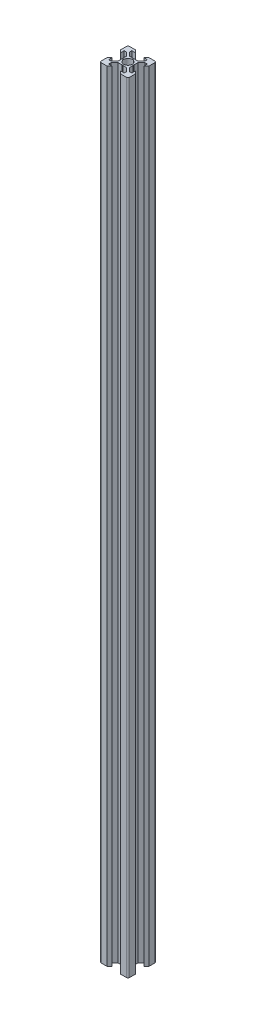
ISO-10303-21;
HEADER;
FILE_DESCRIPTION(('STEP AP214'),'2;1');
FILE_NAME('part.step','',(''),(''),'','','');
FILE_SCHEMA(('AUTOMOTIVE_DESIGN { 1 0 10303 214 1 1 1 1 }'));
ENDSEC;
DATA;
#1=APPLICATION_CONTEXT('core data for automotive mechanical design processes');
#2=APPLICATION_PROTOCOL_DEFINITION('international standard','automotive_design',2000,#1);
#3=PRODUCT_CONTEXT('',#1,'mechanical');
#4=PRODUCT('Part','Part','',(#3));
#5=PRODUCT_RELATED_PRODUCT_CATEGORY('part','',(#4));
#6=PRODUCT_DEFINITION_FORMATION('','',#4);
#7=PRODUCT_DEFINITION_CONTEXT('part definition',#1,'design');
#8=PRODUCT_DEFINITION('design','',#6,#7);
#9=PRODUCT_DEFINITION_SHAPE('','',#8);
#10=(LENGTH_UNIT() NAMED_UNIT(*) SI_UNIT(.MILLI.,.METRE.));
#11=(NAMED_UNIT(*) PLANE_ANGLE_UNIT() SI_UNIT($,.RADIAN.));
#12=(NAMED_UNIT(*) SI_UNIT($,.STERADIAN.) SOLID_ANGLE_UNIT());
#13=UNCERTAINTY_MEASURE_WITH_UNIT(LENGTH_MEASURE(1.E-05),#10,'distance_accuracy_value','');
#14=(GEOMETRIC_REPRESENTATION_CONTEXT(3) GLOBAL_UNCERTAINTY_ASSIGNED_CONTEXT((#13)) GLOBAL_UNIT_ASSIGNED_CONTEXT((#10,
#11,#12)) REPRESENTATION_CONTEXT('',''));
#15=CARTESIAN_POINT('',(0.,0.,0.));
#16=DIRECTION('',(0.,0.,1.));
#17=DIRECTION('',(1.,0.,0.));
#18=AXIS2_PLACEMENT_3D('',#15,#16,#17);
#19=CARTESIAN_POINT('',(8.99964000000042,552.,8.99963999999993));
#20=DIRECTION('',(0.,1.,0.));
#21=DIRECTION('',(0.,0.,1.));
#22=AXIS2_PLACEMENT_3D('',#19,#20,#21);
#23=PLANE('',#22);
#24=CARTESIAN_POINT('',(8.99964000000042,552.,8.99963999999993));
#25=DIRECTION('',(0.,1.,0.));
#26=DIRECTION('',(0.,0.,1.));
#27=AXIS2_PLACEMENT_3D('',#24,#25,#26);
#28=CIRCLE('',#27,0.99996);
#29=CARTESIAN_POINT('',(8.99964000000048,552.,9.99959999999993));
#30=VERTEX_POINT('',#29);
#31=CARTESIAN_POINT('',(9.99960000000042,552.,8.99963999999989));
#32=VERTEX_POINT('',#31);
#33=EDGE_CURVE('E640',#30,#32,#28,.T.);
#34=ORIENTED_EDGE('',*,*,#33,.T.);
#35=DIRECTION('',(0.,0.,-1.));
#36=VECTOR('',#35,1.);
#37=CARTESIAN_POINT('',(9.99960000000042,552.,8.99963999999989));
#38=LINE('',#37,#36);
#39=CARTESIAN_POINT('',(9.99960000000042,552.,4.79980799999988));
#40=VERTEX_POINT('',#39);
#41=EDGE_CURVE('E264',#32,#40,#38,.T.);
#42=ORIENTED_EDGE('',*,*,#41,.T.);
#43=DIRECTION('',(-0.707106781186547,0.,-0.707106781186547));
#44=VECTOR('',#43,1.);
#45=CARTESIAN_POINT('',(9.99960000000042,552.,4.79980799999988));
#46=LINE('',#45,#44);
#47=CARTESIAN_POINT('',(8.19967200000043,552.,2.99987999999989));
#48=VERTEX_POINT('',#47);
#49=EDGE_CURVE('E869',#40,#48,#46,.T.);
#50=ORIENTED_EDGE('',*,*,#49,.T.);
#51=DIRECTION('',(0.,0.,1.));
#52=VECTOR('',#51,1.);
#53=CARTESIAN_POINT('',(8.19967200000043,552.,2.99987999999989));
#54=LINE('',#53,#52);
#55=CARTESIAN_POINT('',(8.19967200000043,552.,5.49977999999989));
#56=VERTEX_POINT('',#55);
#57=EDGE_CURVE('E889',#48,#56,#54,.T.);
#58=ORIENTED_EDGE('',*,*,#57,.T.);
#59=DIRECTION('',(-1.,0.,0.));
#60=VECTOR('',#59,1.);
#61=CARTESIAN_POINT('',(8.19967200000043,552.,5.49977999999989));
#62=LINE('',#61,#60);
#63=CARTESIAN_POINT('',(6.56039774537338,552.,5.49977999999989));
#64=VERTEX_POINT('',#63);
#65=EDGE_CURVE('E885',#56,#64,#62,.T.);
#66=ORIENTED_EDGE('',*,*,#65,.T.);
#67=DIRECTION('',(-0.707106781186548,0.,-0.707106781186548));
#68=VECTOR('',#67,1.);
#69=CARTESIAN_POINT('',(6.56039774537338,552.,5.49977999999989));
#70=LINE('',#69,#68);
#71=CARTESIAN_POINT('',(3.99984000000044,552.,2.93922225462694));
#72=VERTEX_POINT('',#71);
#73=EDGE_CURVE('E888',#64,#72,#70,.T.);
#74=ORIENTED_EDGE('',*,*,#73,.T.);
#75=DIRECTION('',(0.,0.,-1.));
#76=VECTOR('',#75,1.);
#77=CARTESIAN_POINT('',(3.99984000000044,552.,2.93922225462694));
#78=LINE('',#77,#76);
#79=CARTESIAN_POINT('',(3.99984000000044,552.,0.299987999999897));
#80=VERTEX_POINT('',#79);
#81=EDGE_CURVE('E893',#72,#80,#78,.T.);
#82=ORIENTED_EDGE('',*,*,#81,.T.);
#83=DIRECTION('',(-0.707106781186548,0.,-0.707106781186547));
#84=VECTOR('',#83,1.);
#85=CARTESIAN_POINT('',(3.99984000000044,552.,0.299987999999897));
#86=LINE('',#85,#84);
#87=CARTESIAN_POINT('',(3.69985200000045,552.,0.));
#88=VERTEX_POINT('',#87);
#89=EDGE_CURVE('E900',#80,#88,#86,.T.);
#90=ORIENTED_EDGE('',*,*,#89,.T.);
#91=DIRECTION('',(0.707106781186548,0.,-0.707106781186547));
#92=VECTOR('',#91,1.);
#93=CARTESIAN_POINT('',(3.69985200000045,552.,0.));
#94=LINE('',#93,#92);
#95=CARTESIAN_POINT('',(3.99984000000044,552.,-0.299988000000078));
#96=VERTEX_POINT('',#95);
#97=EDGE_CURVE('E903',#88,#96,#94,.T.);
#98=ORIENTED_EDGE('',*,*,#97,.T.);
#99=DIRECTION('',(0.,0.,-1.));
#100=VECTOR('',#99,1.);
#101=CARTESIAN_POINT('',(3.99984000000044,552.,-0.299988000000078));
#102=LINE('',#101,#100);
#103=CARTESIAN_POINT('',(3.99984000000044,552.,-2.93922225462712));
#104=VERTEX_POINT('',#103);
#105=EDGE_CURVE('E906',#96,#104,#102,.T.);
#106=ORIENTED_EDGE('',*,*,#105,.T.);
#107=DIRECTION('',(0.707106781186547,0.,-0.707106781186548));
#108=VECTOR('',#107,1.);
#109=CARTESIAN_POINT('',(3.99984000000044,552.,-2.93922225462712));
#110=LINE('',#109,#108);
#111=CARTESIAN_POINT('',(6.56039774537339,552.,-5.49978000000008));
#112=VERTEX_POINT('',#111);
#113=EDGE_CURVE('E909',#104,#112,#110,.T.);
#114=ORIENTED_EDGE('',*,*,#113,.T.);
#115=DIRECTION('',(1.,0.,0.));
#116=VECTOR('',#115,1.);
#117=CARTESIAN_POINT('',(6.56039774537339,552.,-5.49978000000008));
#118=LINE('',#117,#116);
#119=CARTESIAN_POINT('',(8.1996720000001,552.,-5.49978000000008));
#120=VERTEX_POINT('',#119);
#121=EDGE_CURVE('E912',#112,#120,#118,.T.);
#122=ORIENTED_EDGE('',*,*,#121,.T.);
#123=DIRECTION('',(0.,0.,1.));
#124=VECTOR('',#123,1.);
#125=CARTESIAN_POINT('',(8.1996720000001,552.,-5.49978000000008));
#126=LINE('',#125,#124);
#127=CARTESIAN_POINT('',(8.1996720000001,552.,-2.99987999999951));
#128=VERTEX_POINT('',#127);
#129=EDGE_CURVE('E915',#120,#128,#126,.T.);
#130=ORIENTED_EDGE('',*,*,#129,.T.);
#131=DIRECTION('',(0.707106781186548,0.,-0.707106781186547));
#132=VECTOR('',#131,1.);
#133=CARTESIAN_POINT('',(8.1996720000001,552.,-2.99987999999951));
#134=LINE('',#133,#132);
#135=CARTESIAN_POINT('',(9.99960000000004,552.,-4.79980799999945));
#136=VERTEX_POINT('',#135);
#137=EDGE_CURVE('E918',#128,#136,#134,.T.);
#138=ORIENTED_EDGE('',*,*,#137,.T.);
#139=DIRECTION('',(0.,0.,-1.));
#140=VECTOR('',#139,1.);
#141=CARTESIAN_POINT('',(9.99960000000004,552.,-4.79980799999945));
#142=LINE('',#141,#140);
#143=CARTESIAN_POINT('',(9.99960000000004,552.,-8.99963999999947));
#144=VERTEX_POINT('',#143);
#145=EDGE_CURVE('E921',#136,#144,#142,.T.);
#146=ORIENTED_EDGE('',*,*,#145,.T.);
#147=CARTESIAN_POINT('',(8.99964000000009,552.,-8.9996399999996));
#148=DIRECTION('',(0.,1.,0.));
#149=DIRECTION('',(0.,0.,1.));
#150=AXIS2_PLACEMENT_3D('',#147,#148,#149);
#151=CIRCLE('',#150,0.999959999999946);
#152=CARTESIAN_POINT('',(8.99964000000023,552.,-9.99959999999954));
#153=VERTEX_POINT('',#152);
#154=EDGE_CURVE('E924',#144,#153,#151,.T.);
#155=ORIENTED_EDGE('',*,*,#154,.T.);
#156=DIRECTION('',(-1.,0.,0.));
#157=VECTOR('',#156,1.);
#158=CARTESIAN_POINT('',(8.99964000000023,552.,-9.99959999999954));
#159=LINE('',#158,#157);
#160=CARTESIAN_POINT('',(4.79980800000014,552.,-9.99959999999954));
#161=VERTEX_POINT('',#160);
#162=EDGE_CURVE('E927',#153,#161,#159,.T.);
#163=ORIENTED_EDGE('',*,*,#162,.T.);
#164=DIRECTION('',(-0.707106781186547,0.,0.707106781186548));
#165=VECTOR('',#164,1.);
#166=CARTESIAN_POINT('',(4.79980800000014,552.,-9.99959999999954));
#167=LINE('',#166,#165);
#168=CARTESIAN_POINT('',(2.99988000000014,552.,-8.19967199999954));
#169=VERTEX_POINT('',#168);
#170=EDGE_CURVE('E930',#161,#169,#167,.T.);
#171=ORIENTED_EDGE('',*,*,#170,.T.);
#172=DIRECTION('',(1.,0.,0.));
#173=VECTOR('',#172,1.);
#174=CARTESIAN_POINT('',(2.99988000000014,552.,-8.19967199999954));
#175=LINE('',#174,#173);
#176=CARTESIAN_POINT('',(5.49978000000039,552.,-8.19967199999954));
#177=VERTEX_POINT('',#176);
#178=EDGE_CURVE('E933',#169,#177,#175,.T.);
#179=ORIENTED_EDGE('',*,*,#178,.T.);
#180=DIRECTION('',(0.,0.,1.));
#181=VECTOR('',#180,1.);
#182=CARTESIAN_POINT('',(5.49978000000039,552.,-8.19967199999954));
#183=LINE('',#182,#181);
#184=CARTESIAN_POINT('',(5.49978000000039,552.,-6.56039774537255));
#185=VERTEX_POINT('',#184);
#186=EDGE_CURVE('E936',#177,#185,#183,.T.);
#187=ORIENTED_EDGE('',*,*,#186,.T.);
#188=DIRECTION('',(-0.707106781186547,0.,0.707106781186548));
#189=VECTOR('',#188,1.);
#190=CARTESIAN_POINT('',(5.49978000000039,552.,-6.56039774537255));
#191=LINE('',#190,#189);
#192=CARTESIAN_POINT('',(2.93922225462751,552.,-3.99983999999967));
#193=VERTEX_POINT('',#192);
#194=EDGE_CURVE('E939',#185,#193,#191,.T.);
#195=ORIENTED_EDGE('',*,*,#194,.T.);
#196=DIRECTION('',(-1.,0.,0.));
#197=VECTOR('',#196,1.);
#198=CARTESIAN_POINT('',(2.93922225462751,552.,-3.99983999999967));
#199=LINE('',#198,#197);
#200=CARTESIAN_POINT('',(0.299988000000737,552.,-3.99983999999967));
#201=VERTEX_POINT('',#200);
#202=EDGE_CURVE('E942',#193,#201,#199,.T.);
#203=ORIENTED_EDGE('',*,*,#202,.T.);
#204=DIRECTION('',(-0.707106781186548,0.,0.707106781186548));
#205=VECTOR('',#204,1.);
#206=CARTESIAN_POINT('',(0.299988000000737,552.,-3.99983999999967));
#207=LINE('',#206,#205);
#208=CARTESIAN_POINT('',(7.49352141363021E-13,552.,-3.69985199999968));
#209=VERTEX_POINT('',#208);
#210=EDGE_CURVE('E945',#201,#209,#207,.T.);
#211=ORIENTED_EDGE('',*,*,#210,.T.);
#212=DIRECTION('',(-0.707106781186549,0.,-0.707106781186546));
#213=VECTOR('',#212,1.);
#214=CARTESIAN_POINT('',(7.49352141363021E-13,552.,-3.69985199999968));
#215=LINE('',#214,#213);
#216=CARTESIAN_POINT('',(-0.299987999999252,552.,-3.99983999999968));
#217=VERTEX_POINT('',#216);
#218=EDGE_CURVE('E948',#209,#217,#215,.T.);
#219=ORIENTED_EDGE('',*,*,#218,.T.);
#220=DIRECTION('',(-1.,0.,0.));
#221=VECTOR('',#220,1.);
#222=CARTESIAN_POINT('',(-0.299987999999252,552.,-3.99983999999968));
#223=LINE('',#222,#221);
#224=CARTESIAN_POINT('',(-2.9392222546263,552.,-3.99983999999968));
#225=VERTEX_POINT('',#224);
#226=EDGE_CURVE('E951',#217,#225,#223,.T.);
#227=ORIENTED_EDGE('',*,*,#226,.T.);
#228=DIRECTION('',(-0.707106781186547,0.,-0.707106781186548));
#229=VECTOR('',#228,1.);
#230=CARTESIAN_POINT('',(-2.9392222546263,552.,-3.99983999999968));
#231=LINE('',#230,#229);
#232=CARTESIAN_POINT('',(-5.49977999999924,552.,-6.56039774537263));
#233=VERTEX_POINT('',#232);
#234=EDGE_CURVE('E954',#225,#233,#231,.T.);
#235=ORIENTED_EDGE('',*,*,#234,.T.);
#236=DIRECTION('',(0.,0.,-1.));
#237=VECTOR('',#236,1.);
#238=CARTESIAN_POINT('',(-5.49977999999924,552.,-6.56039774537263));
#239=LINE('',#238,#237);
#240=CARTESIAN_POINT('',(-5.49977999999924,552.,-8.19967200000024));
#241=VERTEX_POINT('',#240);
#242=EDGE_CURVE('E957',#233,#241,#239,.T.);
#243=ORIENTED_EDGE('',*,*,#242,.T.);
#244=DIRECTION('',(1.,0.,0.));
#245=VECTOR('',#244,1.);
#246=CARTESIAN_POINT('',(-5.49977999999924,552.,-8.19967200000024));
#247=LINE('',#246,#245);
#248=CARTESIAN_POINT('',(-2.99988000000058,552.,-8.19967200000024));
#249=VERTEX_POINT('',#248);
#250=EDGE_CURVE('E960',#241,#249,#247,.T.);
#251=ORIENTED_EDGE('',*,*,#250,.T.);
#252=DIRECTION('',(-0.707106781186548,0.,-0.707106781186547));
#253=VECTOR('',#252,1.);
#254=CARTESIAN_POINT('',(-2.99988000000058,552.,-8.19967200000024));
#255=LINE('',#254,#253);
#256=CARTESIAN_POINT('',(-4.79980800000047,552.,-9.99960000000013));
#257=VERTEX_POINT('',#256);
#258=EDGE_CURVE('E963',#249,#257,#255,.T.);
#259=ORIENTED_EDGE('',*,*,#258,.T.);
#260=DIRECTION('',(-1.,0.,0.));
#261=VECTOR('',#260,1.);
#262=CARTESIAN_POINT('',(-4.79980800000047,552.,-9.99960000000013));
#263=LINE('',#262,#261);
#264=CARTESIAN_POINT('',(-8.99963999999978,552.,-9.99960000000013));
#265=VERTEX_POINT('',#264);
#266=EDGE_CURVE('E966',#257,#265,#263,.T.);
#267=ORIENTED_EDGE('',*,*,#266,.T.);
#268=CARTESIAN_POINT('',(-8.99963999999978,552.,-8.99964000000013));
#269=DIRECTION('',(0.,1.,0.));
#270=DIRECTION('',(0.,0.,1.));
#271=AXIS2_PLACEMENT_3D('',#268,#269,#270);
#272=CIRCLE('',#271,0.999959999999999);
#273=CARTESIAN_POINT('',(-9.99959999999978,552.,-8.99964000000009));
#274=VERTEX_POINT('',#273);
#275=EDGE_CURVE('E969',#265,#274,#272,.T.);
#276=ORIENTED_EDGE('',*,*,#275,.T.);
#277=DIRECTION('',(0.,0.,1.));
#278=VECTOR('',#277,1.);
#279=CARTESIAN_POINT('',(-9.99959999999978,552.,-8.99964000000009));
#280=LINE('',#279,#278);
#281=CARTESIAN_POINT('',(-9.99959999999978,552.,-4.79980800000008));
#282=VERTEX_POINT('',#281);
#283=EDGE_CURVE('E972',#274,#282,#280,.T.);
#284=ORIENTED_EDGE('',*,*,#283,.T.);
#285=DIRECTION('',(0.707106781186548,0.,0.707106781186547));
#286=VECTOR('',#285,1.);
#287=CARTESIAN_POINT('',(-9.99959999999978,552.,-4.79980800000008));
#288=LINE('',#287,#286);
#289=CARTESIAN_POINT('',(-8.19967199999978,552.,-2.99988000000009));
#290=VERTEX_POINT('',#289);
#291=EDGE_CURVE('E975',#282,#290,#288,.T.);
#292=ORIENTED_EDGE('',*,*,#291,.T.);
#293=DIRECTION('',(0.,0.,-1.));
#294=VECTOR('',#293,1.);
#295=CARTESIAN_POINT('',(-8.19967199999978,552.,-2.99988000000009));
#296=LINE('',#295,#294);
#297=CARTESIAN_POINT('',(-8.19967199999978,552.,-5.49978000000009));
#298=VERTEX_POINT('',#297);
#299=EDGE_CURVE('E978',#290,#298,#296,.T.);
#300=ORIENTED_EDGE('',*,*,#299,.T.);
#301=DIRECTION('',(1.,0.,0.));
#302=VECTOR('',#301,1.);
#303=CARTESIAN_POINT('',(-8.19967199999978,552.,-5.49978000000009));
#304=LINE('',#303,#302);
#305=CARTESIAN_POINT('',(-6.56039774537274,552.,-5.49978000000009));
#306=VERTEX_POINT('',#305);
#307=EDGE_CURVE('E981',#298,#306,#304,.T.);
#308=ORIENTED_EDGE('',*,*,#307,.T.);
#309=DIRECTION('',(0.707106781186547,0.,0.707106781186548));
#310=VECTOR('',#309,1.);
#311=CARTESIAN_POINT('',(-6.56039774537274,552.,-5.49978000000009));
#312=LINE('',#311,#310);
#313=CARTESIAN_POINT('',(-3.9998399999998,552.,-2.93922225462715));
#314=VERTEX_POINT('',#313);
#315=EDGE_CURVE('E984',#306,#314,#312,.T.);
#316=ORIENTED_EDGE('',*,*,#315,.T.);
#317=DIRECTION('',(0.,0.,1.));
#318=VECTOR('',#317,1.);
#319=CARTESIAN_POINT('',(-3.9998399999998,552.,-2.93922225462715));
#320=LINE('',#319,#318);
#321=CARTESIAN_POINT('',(-3.9998399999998,552.,-0.299988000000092));
#322=VERTEX_POINT('',#321);
#323=EDGE_CURVE('E987',#314,#322,#320,.T.);
#324=ORIENTED_EDGE('',*,*,#323,.T.);
#325=DIRECTION('',(0.707106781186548,0.,0.707106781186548));
#326=VECTOR('',#325,1.);
#327=CARTESIAN_POINT('',(-3.9998399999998,552.,-0.299988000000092));
#328=LINE('',#327,#326);
#329=CARTESIAN_POINT('',(-3.69985199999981,552.,-1.04081468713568E-13));
#330=VERTEX_POINT('',#329);
#331=EDGE_CURVE('E990',#322,#330,#328,.T.);
#332=ORIENTED_EDGE('',*,*,#331,.T.);
#333=DIRECTION('',(-0.707106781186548,0.,0.707106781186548));
#334=VECTOR('',#333,1.);
#335=CARTESIAN_POINT('',(-3.69985199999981,552.,-1.04081468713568E-13));
#336=LINE('',#335,#334);
#337=CARTESIAN_POINT('',(-3.9998399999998,552.,0.299987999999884));
#338=VERTEX_POINT('',#337);
#339=EDGE_CURVE('E993',#330,#338,#336,.T.);
#340=ORIENTED_EDGE('',*,*,#339,.T.);
#341=DIRECTION('',(0.,0.,1.));
#342=VECTOR('',#341,1.);
#343=CARTESIAN_POINT('',(-3.9998399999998,552.,0.299987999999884));
#344=LINE('',#343,#342);
#345=CARTESIAN_POINT('',(-3.99983999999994,552.,2.93922225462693));
#346=VERTEX_POINT('',#345);
#347=EDGE_CURVE('E996',#338,#346,#344,.T.);
#348=ORIENTED_EDGE('',*,*,#347,.T.);
#349=DIRECTION('',(-0.707106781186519,0.,0.707106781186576));
#350=VECTOR('',#349,1.);
#351=CARTESIAN_POINT('',(-3.99983999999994,552.,2.93922225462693));
#352=LINE('',#351,#350);
#353=CARTESIAN_POINT('',(-6.56039774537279,552.,5.49977999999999));
#354=VERTEX_POINT('',#353);
#355=EDGE_CURVE('E999',#346,#354,#352,.T.);
#356=ORIENTED_EDGE('',*,*,#355,.T.);
#357=DIRECTION('',(-1.,0.,0.));
#358=VECTOR('',#357,1.);
#359=CARTESIAN_POINT('',(-6.56039774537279,552.,5.49977999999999));
#360=LINE('',#359,#358);
#361=CARTESIAN_POINT('',(-8.19967199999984,552.,5.49978000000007));
#362=VERTEX_POINT('',#361);
#363=EDGE_CURVE('E1002',#354,#362,#360,.T.);
#364=ORIENTED_EDGE('',*,*,#363,.T.);
#365=DIRECTION('',(0.,0.,-1.));
#366=VECTOR('',#365,1.);
#367=CARTESIAN_POINT('',(-8.19967199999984,552.,5.49978000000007));
#368=LINE('',#367,#366);
#369=CARTESIAN_POINT('',(-8.19967199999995,552.,2.99988000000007));
#370=VERTEX_POINT('',#369);
#371=EDGE_CURVE('E1005',#362,#370,#368,.T.);
#372=ORIENTED_EDGE('',*,*,#371,.T.);
#373=DIRECTION('',(-0.707106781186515,0.,0.70710678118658));
#374=VECTOR('',#373,1.);
#375=CARTESIAN_POINT('',(-8.19967199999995,552.,2.99988000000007));
#376=LINE('',#375,#374);
#377=CARTESIAN_POINT('',(-9.99959999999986,552.,4.79980800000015));
#378=VERTEX_POINT('',#377);
#379=EDGE_CURVE('E1008',#370,#378,#376,.T.);
#380=ORIENTED_EDGE('',*,*,#379,.T.);
#381=DIRECTION('',(0.,0.,1.));
#382=VECTOR('',#381,1.);
#383=CARTESIAN_POINT('',(-9.99959999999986,552.,4.79980800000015));
#384=LINE('',#383,#382);
#385=CARTESIAN_POINT('',(-9.99959999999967,552.,8.99964000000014));
#386=VERTEX_POINT('',#385);
#387=EDGE_CURVE('E1011',#378,#386,#384,.T.);
#388=ORIENTED_EDGE('',*,*,#387,.T.);
#389=CARTESIAN_POINT('',(-8.99963999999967,552.,8.9996400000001));
#390=DIRECTION('',(0.,1.,0.));
#391=DIRECTION('',(0.,0.,1.));
#392=AXIS2_PLACEMENT_3D('',#389,#390,#391);
#393=CIRCLE('',#392,0.99996);
#394=CARTESIAN_POINT('',(-8.99963999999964,552.,9.9996000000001));
#395=VERTEX_POINT('',#394);
#396=EDGE_CURVE('E1014',#386,#395,#393,.T.);
#397=ORIENTED_EDGE('',*,*,#396,.T.);
#398=DIRECTION('',(1.,0.,0.));
#399=VECTOR('',#398,1.);
#400=CARTESIAN_POINT('',(-8.99963999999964,552.,9.9996000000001));
#401=LINE('',#400,#399);
#402=CARTESIAN_POINT('',(-4.79980799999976,552.,9.9996000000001));
#403=VERTEX_POINT('',#402);
#404=EDGE_CURVE('E1017',#395,#403,#401,.T.);
#405=ORIENTED_EDGE('',*,*,#404,.T.);
#406=DIRECTION('',(0.707106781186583,0.,-0.707106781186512));
#407=VECTOR('',#406,1.);
#408=CARTESIAN_POINT('',(-4.79980799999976,552.,9.9996000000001));
#409=LINE('',#408,#407);
#410=CARTESIAN_POINT('',(-2.99987999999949,552.,8.19967200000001));
#411=VERTEX_POINT('',#410);
#412=EDGE_CURVE('E1020',#403,#411,#409,.T.);
#413=ORIENTED_EDGE('',*,*,#412,.T.);
#414=DIRECTION('',(-1.,0.,0.));
#415=VECTOR('',#414,1.);
#416=CARTESIAN_POINT('',(-2.99987999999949,552.,8.19967200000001));
#417=LINE('',#416,#415);
#418=CARTESIAN_POINT('',(-5.49977999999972,552.,8.19967199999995));
#419=VERTEX_POINT('',#418);
#420=EDGE_CURVE('E1023',#411,#419,#417,.T.);
#421=ORIENTED_EDGE('',*,*,#420,.T.);
#422=DIRECTION('',(0.,0.,-1.));
#423=VECTOR('',#422,1.);
#424=CARTESIAN_POINT('',(-5.49977999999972,552.,8.19967199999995));
#425=LINE('',#424,#423);
#426=CARTESIAN_POINT('',(-5.49977999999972,552.,6.56039774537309));
#427=VERTEX_POINT('',#426);
#428=EDGE_CURVE('E1026',#419,#427,#425,.T.);
#429=ORIENTED_EDGE('',*,*,#428,.T.);
#430=DIRECTION('',(0.707106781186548,0.,-0.707106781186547));
#431=VECTOR('',#430,1.);
#432=CARTESIAN_POINT('',(-5.49977999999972,552.,6.56039774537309));
#433=LINE('',#432,#431);
#434=CARTESIAN_POINT('',(-2.93922225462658,552.,3.99983999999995));
#435=VERTEX_POINT('',#434);
#436=EDGE_CURVE('E1029',#427,#435,#433,.T.);
#437=ORIENTED_EDGE('',*,*,#436,.T.);
#438=DIRECTION('',(1.,0.,0.));
#439=VECTOR('',#438,1.);
#440=CARTESIAN_POINT('',(-2.93922225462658,552.,3.99983999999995));
#441=LINE('',#440,#439);
#442=CARTESIAN_POINT('',(-0.299987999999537,552.,3.99983999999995));
#443=VERTEX_POINT('',#442);
#444=EDGE_CURVE('E1032',#435,#443,#441,.T.);
#445=ORIENTED_EDGE('',*,*,#444,.T.);
#446=DIRECTION('',(0.707106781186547,0.,-0.707106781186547));
#447=VECTOR('',#446,1.);
#448=CARTESIAN_POINT('',(-0.299987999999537,552.,3.99983999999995));
#449=LINE('',#448,#447);
#450=CARTESIAN_POINT('',(4.57894783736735E-13,552.,3.69985199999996));
#451=VERTEX_POINT('',#450);
#452=EDGE_CURVE('E1035',#443,#451,#449,.T.);
#453=ORIENTED_EDGE('',*,*,#452,.T.);
#454=DIRECTION('',(0.707106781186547,0.,0.707106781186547));
#455=VECTOR('',#454,1.);
#456=CARTESIAN_POINT('',(4.57894783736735E-13,552.,3.69985199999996));
#457=LINE('',#456,#455);
#458=CARTESIAN_POINT('',(0.299988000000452,552.,3.99983999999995));
#459=VERTEX_POINT('',#458);
#460=EDGE_CURVE('E1038',#451,#459,#457,.T.);
#461=ORIENTED_EDGE('',*,*,#460,.T.);
#462=DIRECTION('',(1.,0.,0.));
#463=VECTOR('',#462,1.);
#464=CARTESIAN_POINT('',(0.299988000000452,552.,3.99983999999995));
#465=LINE('',#464,#463);
#466=CARTESIAN_POINT('',(2.93922225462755,552.,3.99983999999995));
#467=VERTEX_POINT('',#466);
#468=EDGE_CURVE('E1041',#459,#467,#465,.T.);
#469=ORIENTED_EDGE('',*,*,#468,.T.);
#470=DIRECTION('',(0.707106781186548,0.,0.707106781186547));
#471=VECTOR('',#470,1.);
#472=CARTESIAN_POINT('',(2.93922225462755,552.,3.99983999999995));
#473=LINE('',#472,#471);
#474=CARTESIAN_POINT('',(5.49978000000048,552.,6.56039774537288));
#475=VERTEX_POINT('',#474);
#476=EDGE_CURVE('E1044',#467,#475,#473,.T.);
#477=ORIENTED_EDGE('',*,*,#476,.T.);
#478=DIRECTION('',(0.,0.,1.));
#479=VECTOR('',#478,1.);
#480=CARTESIAN_POINT('',(5.49978000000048,552.,6.56039774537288));
#481=LINE('',#480,#479);
#482=CARTESIAN_POINT('',(5.49978000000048,552.,8.19967199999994));
#483=VERTEX_POINT('',#482);
#484=EDGE_CURVE('E439',#475,#483,#481,.T.);
#485=ORIENTED_EDGE('',*,*,#484,.T.);
#486=DIRECTION('',(-1.,0.,0.));
#487=VECTOR('',#486,1.);
#488=CARTESIAN_POINT('',(5.49978000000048,552.,8.19967199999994));
#489=LINE('',#488,#487);
#490=CARTESIAN_POINT('',(2.99988000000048,552.,8.19967199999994));
#491=VERTEX_POINT('',#490);
#492=EDGE_CURVE('E433',#483,#491,#489,.T.);
#493=ORIENTED_EDGE('',*,*,#492,.T.);
#494=DIRECTION('',(0.707106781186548,0.,0.707106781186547));
#495=VECTOR('',#494,1.);
#496=CARTESIAN_POINT('',(2.99988000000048,552.,8.19967199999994));
#497=LINE('',#496,#495);
#498=CARTESIAN_POINT('',(4.79980800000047,552.,9.99959999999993));
#499=VERTEX_POINT('',#498);
#500=EDGE_CURVE('E437',#491,#499,#497,.T.);
#501=ORIENTED_EDGE('',*,*,#500,.T.);
#502=DIRECTION('',(1.,0.,0.));
#503=VECTOR('',#502,1.);
#504=CARTESIAN_POINT('',(4.79980800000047,552.,9.99959999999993));
#505=LINE('',#504,#503);
#506=EDGE_CURVE('E65',#499,#30,#505,.T.);
#507=ORIENTED_EDGE('',*,*,#506,.T.);
#508=EDGE_LOOP('',(#34,#42,#50,#58,#66,#74,#82,#90,#98,#106,#114,#122,#130,#138,#146,#155,#163,
#171,#179,#187,#195,#203,#211,#219,#227,#235,#243,#251,#259,#267,#276,#284,#292,#300,#308,#316,
#324,#332,#340,#348,#356,#364,#372,#380,#388,#397,#405,#413,#421,#429,#437,#445,#453,#461,#469,
#477,#485,#493,#501,#507));
#509=FACE_BOUND('',#508,.T.);
#510=CARTESIAN_POINT('',(0.,552.,0.));
#511=DIRECTION('',(0.,1.,0.));
#512=DIRECTION('',(0.,0.,1.));
#513=AXIS2_PLACEMENT_3D('',#510,#511,#512);
#514=CIRCLE('',#513,3.);
#515=CARTESIAN_POINT('',(0.,552.,3.));
#516=VERTEX_POINT('',#515);
#517=EDGE_CURVE('E466',#516,#516,#514,.T.);
#518=ORIENTED_EDGE('',*,*,#517,.F.);
#519=EDGE_LOOP('',(#518));
#520=FACE_BOUND('',#519,.T.);
#521=ADVANCED_FACE('F47',(#509,#520),#23,.T.);
#522=CARTESIAN_POINT('',(8.99964000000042,0.,8.99963999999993));
#523=DIRECTION('',(0.,1.,0.));
#524=DIRECTION('',(0.,0.,1.));
#525=AXIS2_PLACEMENT_3D('',#522,#523,#524);
#526=PLANE('',#525);
#527=CARTESIAN_POINT('',(8.99964000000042,0.,8.99963999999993));
#528=DIRECTION('',(0.,1.,0.));
#529=DIRECTION('',(0.,0.,1.));
#530=AXIS2_PLACEMENT_3D('',#527,#528,#529);
#531=CIRCLE('',#530,0.99996);
#532=CARTESIAN_POINT('',(8.99964000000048,0.,9.99959999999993));
#533=VERTEX_POINT('',#532);
#534=CARTESIAN_POINT('',(9.99960000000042,0.,8.99963999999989));
#535=VERTEX_POINT('',#534);
#536=EDGE_CURVE('E461',#533,#535,#531,.T.);
#537=ORIENTED_EDGE('',*,*,#536,.F.);
#538=DIRECTION('',(1.,0.,0.));
#539=VECTOR('',#538,1.);
#540=CARTESIAN_POINT('',(4.79980800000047,0.,9.99959999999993));
#541=LINE('',#540,#539);
#542=CARTESIAN_POINT('',(4.79980800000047,0.,9.99959999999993));
#543=VERTEX_POINT('',#542);
#544=EDGE_CURVE('E256',#543,#533,#541,.T.);
#545=ORIENTED_EDGE('',*,*,#544,.F.);
#546=DIRECTION('',(0.707106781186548,0.,0.707106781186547));
#547=VECTOR('',#546,1.);
#548=CARTESIAN_POINT('',(2.99988000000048,0.,8.19967199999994));
#549=LINE('',#548,#547);
#550=CARTESIAN_POINT('',(2.99988000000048,0.,8.19967199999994));
#551=VERTEX_POINT('',#550);
#552=EDGE_CURVE('E250',#551,#543,#549,.T.);
#553=ORIENTED_EDGE('',*,*,#552,.F.);
#554=DIRECTION('',(-1.,0.,0.));
#555=VECTOR('',#554,1.);
#556=CARTESIAN_POINT('',(5.49978000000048,0.,8.19967199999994));
#557=LINE('',#556,#555);
#558=CARTESIAN_POINT('',(5.49978000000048,0.,8.19967199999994));
#559=VERTEX_POINT('',#558);
#560=EDGE_CURVE('E448',#559,#551,#557,.T.);
#561=ORIENTED_EDGE('',*,*,#560,.F.);
#562=DIRECTION('',(0.,0.,1.));
#563=VECTOR('',#562,1.);
#564=CARTESIAN_POINT('',(5.49978000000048,0.,6.56039774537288));
#565=LINE('',#564,#563);
#566=CARTESIAN_POINT('',(5.49978000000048,0.,6.56039774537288));
#567=VERTEX_POINT('',#566);
#568=EDGE_CURVE('E631',#567,#559,#565,.T.);
#569=ORIENTED_EDGE('',*,*,#568,.F.);
#570=DIRECTION('',(0.707106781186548,0.,0.707106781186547));
#571=VECTOR('',#570,1.);
#572=CARTESIAN_POINT('',(2.93922225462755,0.,3.99983999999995));
#573=LINE('',#572,#571);
#574=CARTESIAN_POINT('',(2.93922225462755,0.,3.99983999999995));
#575=VERTEX_POINT('',#574);
#576=EDGE_CURVE('E628',#575,#567,#573,.T.);
#577=ORIENTED_EDGE('',*,*,#576,.F.);
#578=DIRECTION('',(1.,0.,0.));
#579=VECTOR('',#578,1.);
#580=CARTESIAN_POINT('',(0.299988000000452,0.,3.99983999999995));
#581=LINE('',#580,#579);
#582=CARTESIAN_POINT('',(0.299988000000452,0.,3.99983999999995));
#583=VERTEX_POINT('',#582);
#584=EDGE_CURVE('E625',#583,#575,#581,.T.);
#585=ORIENTED_EDGE('',*,*,#584,.F.);
#586=DIRECTION('',(0.707106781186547,0.,0.707106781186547));
#587=VECTOR('',#586,1.);
#588=CARTESIAN_POINT('',(4.57894783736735E-13,0.,3.69985199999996));
#589=LINE('',#588,#587);
#590=CARTESIAN_POINT('',(4.57894783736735E-13,0.,3.69985199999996));
#591=VERTEX_POINT('',#590);
#592=EDGE_CURVE('E622',#591,#583,#589,.T.);
#593=ORIENTED_EDGE('',*,*,#592,.F.);
#594=DIRECTION('',(0.707106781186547,0.,-0.707106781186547));
#595=VECTOR('',#594,1.);
#596=CARTESIAN_POINT('',(-0.299987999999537,0.,3.99983999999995));
#597=LINE('',#596,#595);
#598=CARTESIAN_POINT('',(-0.299987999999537,0.,3.99983999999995));
#599=VERTEX_POINT('',#598);
#600=EDGE_CURVE('E619',#599,#591,#597,.T.);
#601=ORIENTED_EDGE('',*,*,#600,.F.);
#602=DIRECTION('',(1.,0.,0.));
#603=VECTOR('',#602,1.);
#604=CARTESIAN_POINT('',(-2.93922225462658,0.,3.99983999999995));
#605=LINE('',#604,#603);
#606=CARTESIAN_POINT('',(-2.93922225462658,0.,3.99983999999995));
#607=VERTEX_POINT('',#606);
#608=EDGE_CURVE('E616',#607,#599,#605,.T.);
#609=ORIENTED_EDGE('',*,*,#608,.F.);
#610=DIRECTION('',(0.707106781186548,0.,-0.707106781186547));
#611=VECTOR('',#610,1.);
#612=CARTESIAN_POINT('',(-5.49977999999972,0.,6.56039774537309));
#613=LINE('',#612,#611);
#614=CARTESIAN_POINT('',(-5.49977999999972,0.,6.56039774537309));
#615=VERTEX_POINT('',#614);
#616=EDGE_CURVE('E613',#615,#607,#613,.T.);
#617=ORIENTED_EDGE('',*,*,#616,.F.);
#618=DIRECTION('',(0.,0.,-1.));
#619=VECTOR('',#618,1.);
#620=CARTESIAN_POINT('',(-5.49977999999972,0.,8.19967199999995));
#621=LINE('',#620,#619);
#622=CARTESIAN_POINT('',(-5.49977999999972,0.,8.19967199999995));
#623=VERTEX_POINT('',#622);
#624=EDGE_CURVE('E610',#623,#615,#621,.T.);
#625=ORIENTED_EDGE('',*,*,#624,.F.);
#626=DIRECTION('',(-1.,0.,0.));
#627=VECTOR('',#626,1.);
#628=CARTESIAN_POINT('',(-2.99987999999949,0.,8.19967200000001));
#629=LINE('',#628,#627);
#630=CARTESIAN_POINT('',(-2.99987999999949,0.,8.19967200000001));
#631=VERTEX_POINT('',#630);
#632=EDGE_CURVE('E607',#631,#623,#629,.T.);
#633=ORIENTED_EDGE('',*,*,#632,.F.);
#634=DIRECTION('',(0.707106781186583,0.,-0.707106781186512));
#635=VECTOR('',#634,1.);
#636=CARTESIAN_POINT('',(-4.79980799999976,0.,9.9996000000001));
#637=LINE('',#636,#635);
#638=CARTESIAN_POINT('',(-4.79980799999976,0.,9.9996000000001));
#639=VERTEX_POINT('',#638);
#640=EDGE_CURVE('E604',#639,#631,#637,.T.);
#641=ORIENTED_EDGE('',*,*,#640,.F.);
#642=DIRECTION('',(1.,0.,0.));
#643=VECTOR('',#642,1.);
#644=CARTESIAN_POINT('',(-8.99963999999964,0.,9.9996000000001));
#645=LINE('',#644,#643);
#646=CARTESIAN_POINT('',(-8.99963999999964,0.,9.9996000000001));
#647=VERTEX_POINT('',#646);
#648=EDGE_CURVE('E601',#647,#639,#645,.T.);
#649=ORIENTED_EDGE('',*,*,#648,.F.);
#650=CARTESIAN_POINT('',(-8.99963999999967,0.,8.9996400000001));
#651=DIRECTION('',(0.,1.,0.));
#652=DIRECTION('',(0.,0.,1.));
#653=AXIS2_PLACEMENT_3D('',#650,#651,#652);
#654=CIRCLE('',#653,0.99996);
#655=CARTESIAN_POINT('',(-9.99959999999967,0.,8.99964000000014));
#656=VERTEX_POINT('',#655);
#657=EDGE_CURVE('E598',#656,#647,#654,.T.);
#658=ORIENTED_EDGE('',*,*,#657,.F.);
#659=DIRECTION('',(0.,0.,1.));
#660=VECTOR('',#659,1.);
#661=CARTESIAN_POINT('',(-9.99959999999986,0.,4.79980800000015));
#662=LINE('',#661,#660);
#663=CARTESIAN_POINT('',(-9.99959999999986,0.,4.79980800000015));
#664=VERTEX_POINT('',#663);
#665=EDGE_CURVE('E595',#664,#656,#662,.T.);
#666=ORIENTED_EDGE('',*,*,#665,.F.);
#667=DIRECTION('',(-0.707106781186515,0.,0.70710678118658));
#668=VECTOR('',#667,1.);
#669=CARTESIAN_POINT('',(-8.19967199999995,0.,2.99988000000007));
#670=LINE('',#669,#668);
#671=CARTESIAN_POINT('',(-8.19967199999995,0.,2.99988000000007));
#672=VERTEX_POINT('',#671);
#673=EDGE_CURVE('E592',#672,#664,#670,.T.);
#674=ORIENTED_EDGE('',*,*,#673,.F.);
#675=DIRECTION('',(0.,0.,-1.));
#676=VECTOR('',#675,1.);
#677=CARTESIAN_POINT('',(-8.19967199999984,0.,5.49978000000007));
#678=LINE('',#677,#676);
#679=CARTESIAN_POINT('',(-8.19967199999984,0.,5.49978000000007));
#680=VERTEX_POINT('',#679);
#681=EDGE_CURVE('E589',#680,#672,#678,.T.);
#682=ORIENTED_EDGE('',*,*,#681,.F.);
#683=DIRECTION('',(-1.,0.,0.));
#684=VECTOR('',#683,1.);
#685=CARTESIAN_POINT('',(-6.56039774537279,0.,5.49977999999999));
#686=LINE('',#685,#684);
#687=CARTESIAN_POINT('',(-6.56039774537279,0.,5.49977999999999));
#688=VERTEX_POINT('',#687);
#689=EDGE_CURVE('E586',#688,#680,#686,.T.);
#690=ORIENTED_EDGE('',*,*,#689,.F.);
#691=DIRECTION('',(-0.707106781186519,0.,0.707106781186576));
#692=VECTOR('',#691,1.);
#693=CARTESIAN_POINT('',(-3.99983999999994,0.,2.93922225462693));
#694=LINE('',#693,#692);
#695=CARTESIAN_POINT('',(-3.99983999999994,0.,2.93922225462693));
#696=VERTEX_POINT('',#695);
#697=EDGE_CURVE('E583',#696,#688,#694,.T.);
#698=ORIENTED_EDGE('',*,*,#697,.F.);
#699=DIRECTION('',(0.,0.,1.));
#700=VECTOR('',#699,1.);
#701=CARTESIAN_POINT('',(-3.9998399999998,0.,0.299987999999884));
#702=LINE('',#701,#700);
#703=CARTESIAN_POINT('',(-3.9998399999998,0.,0.299987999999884));
#704=VERTEX_POINT('',#703);
#705=EDGE_CURVE('E580',#704,#696,#702,.T.);
#706=ORIENTED_EDGE('',*,*,#705,.F.);
#707=DIRECTION('',(-0.707106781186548,0.,0.707106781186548));
#708=VECTOR('',#707,1.);
#709=CARTESIAN_POINT('',(-3.69985199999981,0.,-1.04081468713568E-13));
#710=LINE('',#709,#708);
#711=CARTESIAN_POINT('',(-3.69985199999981,0.,-1.04081468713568E-13));
#712=VERTEX_POINT('',#711);
#713=EDGE_CURVE('E577',#712,#704,#710,.T.);
#714=ORIENTED_EDGE('',*,*,#713,.F.);
#715=DIRECTION('',(0.707106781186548,0.,0.707106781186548));
#716=VECTOR('',#715,1.);
#717=CARTESIAN_POINT('',(-3.9998399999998,0.,-0.299988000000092));
#718=LINE('',#717,#716);
#719=CARTESIAN_POINT('',(-3.9998399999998,0.,-0.299988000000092));
#720=VERTEX_POINT('',#719);
#721=EDGE_CURVE('E574',#720,#712,#718,.T.);
#722=ORIENTED_EDGE('',*,*,#721,.F.);
#723=DIRECTION('',(0.,0.,1.));
#724=VECTOR('',#723,1.);
#725=CARTESIAN_POINT('',(-3.9998399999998,0.,-2.93922225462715));
#726=LINE('',#725,#724);
#727=CARTESIAN_POINT('',(-3.9998399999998,0.,-2.93922225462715));
#728=VERTEX_POINT('',#727);
#729=EDGE_CURVE('E571',#728,#720,#726,.T.);
#730=ORIENTED_EDGE('',*,*,#729,.F.);
#731=DIRECTION('',(0.707106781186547,0.,0.707106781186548));
#732=VECTOR('',#731,1.);
#733=CARTESIAN_POINT('',(-6.56039774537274,0.,-5.49978000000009));
#734=LINE('',#733,#732);
#735=CARTESIAN_POINT('',(-6.56039774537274,0.,-5.49978000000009));
#736=VERTEX_POINT('',#735);
#737=EDGE_CURVE('E568',#736,#728,#734,.T.);
#738=ORIENTED_EDGE('',*,*,#737,.F.);
#739=DIRECTION('',(1.,0.,0.));
#740=VECTOR('',#739,1.);
#741=CARTESIAN_POINT('',(-8.19967199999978,0.,-5.49978000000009));
#742=LINE('',#741,#740);
#743=CARTESIAN_POINT('',(-8.19967199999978,0.,-5.49978000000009));
#744=VERTEX_POINT('',#743);
#745=EDGE_CURVE('E565',#744,#736,#742,.T.);
#746=ORIENTED_EDGE('',*,*,#745,.F.);
#747=DIRECTION('',(0.,0.,-1.));
#748=VECTOR('',#747,1.);
#749=CARTESIAN_POINT('',(-8.19967199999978,0.,-2.99988000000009));
#750=LINE('',#749,#748);
#751=CARTESIAN_POINT('',(-8.19967199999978,0.,-2.99988000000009));
#752=VERTEX_POINT('',#751);
#753=EDGE_CURVE('E562',#752,#744,#750,.T.);
#754=ORIENTED_EDGE('',*,*,#753,.F.);
#755=DIRECTION('',(0.707106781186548,0.,0.707106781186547));
#756=VECTOR('',#755,1.);
#757=CARTESIAN_POINT('',(-9.99959999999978,0.,-4.79980800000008));
#758=LINE('',#757,#756);
#759=CARTESIAN_POINT('',(-9.99959999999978,0.,-4.79980800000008));
#760=VERTEX_POINT('',#759);
#761=EDGE_CURVE('E559',#760,#752,#758,.T.);
#762=ORIENTED_EDGE('',*,*,#761,.F.);
#763=DIRECTION('',(0.,0.,1.));
#764=VECTOR('',#763,1.);
#765=CARTESIAN_POINT('',(-9.99959999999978,0.,-8.99964000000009));
#766=LINE('',#765,#764);
#767=CARTESIAN_POINT('',(-9.99959999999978,0.,-8.99964000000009));
#768=VERTEX_POINT('',#767);
#769=EDGE_CURVE('E556',#768,#760,#766,.T.);
#770=ORIENTED_EDGE('',*,*,#769,.F.);
#771=CARTESIAN_POINT('',(-8.99963999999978,0.,-8.99964000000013));
#772=DIRECTION('',(0.,1.,0.));
#773=DIRECTION('',(0.,0.,1.));
#774=AXIS2_PLACEMENT_3D('',#771,#772,#773);
#775=CIRCLE('',#774,0.999959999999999);
#776=CARTESIAN_POINT('',(-8.99963999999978,0.,-9.99960000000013));
#777=VERTEX_POINT('',#776);
#778=EDGE_CURVE('E553',#777,#768,#775,.T.);
#779=ORIENTED_EDGE('',*,*,#778,.F.);
#780=DIRECTION('',(-1.,0.,0.));
#781=VECTOR('',#780,1.);
#782=CARTESIAN_POINT('',(-4.79980800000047,0.,-9.99960000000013));
#783=LINE('',#782,#781);
#784=CARTESIAN_POINT('',(-4.79980800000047,0.,-9.99960000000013));
#785=VERTEX_POINT('',#784);
#786=EDGE_CURVE('E550',#785,#777,#783,.T.);
#787=ORIENTED_EDGE('',*,*,#786,.F.);
#788=DIRECTION('',(-0.707106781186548,0.,-0.707106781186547));
#789=VECTOR('',#788,1.);
#790=CARTESIAN_POINT('',(-2.99988000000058,0.,-8.19967200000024));
#791=LINE('',#790,#789);
#792=CARTESIAN_POINT('',(-2.99988000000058,0.,-8.19967200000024));
#793=VERTEX_POINT('',#792);
#794=EDGE_CURVE('E547',#793,#785,#791,.T.);
#795=ORIENTED_EDGE('',*,*,#794,.F.);
#796=DIRECTION('',(1.,0.,0.));
#797=VECTOR('',#796,1.);
#798=CARTESIAN_POINT('',(-5.49977999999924,0.,-8.19967200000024));
#799=LINE('',#798,#797);
#800=CARTESIAN_POINT('',(-5.49977999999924,0.,-8.19967200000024));
#801=VERTEX_POINT('',#800);
#802=EDGE_CURVE('E544',#801,#793,#799,.T.);
#803=ORIENTED_EDGE('',*,*,#802,.F.);
#804=DIRECTION('',(0.,0.,-1.));
#805=VECTOR('',#804,1.);
#806=CARTESIAN_POINT('',(-5.49977999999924,0.,-6.56039774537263));
#807=LINE('',#806,#805);
#808=CARTESIAN_POINT('',(-5.49977999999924,0.,-6.56039774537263));
#809=VERTEX_POINT('',#808);
#810=EDGE_CURVE('E541',#809,#801,#807,.T.);
#811=ORIENTED_EDGE('',*,*,#810,.F.);
#812=DIRECTION('',(-0.707106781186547,0.,-0.707106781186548));
#813=VECTOR('',#812,1.);
#814=CARTESIAN_POINT('',(-2.9392222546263,0.,-3.99983999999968));
#815=LINE('',#814,#813);
#816=CARTESIAN_POINT('',(-2.9392222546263,0.,-3.99983999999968));
#817=VERTEX_POINT('',#816);
#818=EDGE_CURVE('E538',#817,#809,#815,.T.);
#819=ORIENTED_EDGE('',*,*,#818,.F.);
#820=DIRECTION('',(-1.,0.,0.));
#821=VECTOR('',#820,1.);
#822=CARTESIAN_POINT('',(-0.299987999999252,0.,-3.99983999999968));
#823=LINE('',#822,#821);
#824=CARTESIAN_POINT('',(-0.299987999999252,0.,-3.99983999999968));
#825=VERTEX_POINT('',#824);
#826=EDGE_CURVE('E535',#825,#817,#823,.T.);
#827=ORIENTED_EDGE('',*,*,#826,.F.);
#828=DIRECTION('',(-0.707106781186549,0.,-0.707106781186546));
#829=VECTOR('',#828,1.);
#830=CARTESIAN_POINT('',(7.49352141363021E-13,0.,-3.69985199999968));
#831=LINE('',#830,#829);
#832=CARTESIAN_POINT('',(7.49352141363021E-13,0.,-3.69985199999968));
#833=VERTEX_POINT('',#832);
#834=EDGE_CURVE('E532',#833,#825,#831,.T.);
#835=ORIENTED_EDGE('',*,*,#834,.F.);
#836=DIRECTION('',(-0.707106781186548,0.,0.707106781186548));
#837=VECTOR('',#836,1.);
#838=CARTESIAN_POINT('',(0.299988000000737,0.,-3.99983999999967));
#839=LINE('',#838,#837);
#840=CARTESIAN_POINT('',(0.299988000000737,0.,-3.99983999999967));
#841=VERTEX_POINT('',#840);
#842=EDGE_CURVE('E529',#841,#833,#839,.T.);
#843=ORIENTED_EDGE('',*,*,#842,.F.);
#844=DIRECTION('',(-1.,0.,0.));
#845=VECTOR('',#844,1.);
#846=CARTESIAN_POINT('',(2.93922225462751,0.,-3.99983999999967));
#847=LINE('',#846,#845);
#848=CARTESIAN_POINT('',(2.93922225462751,0.,-3.99983999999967));
#849=VERTEX_POINT('',#848);
#850=EDGE_CURVE('E526',#849,#841,#847,.T.);
#851=ORIENTED_EDGE('',*,*,#850,.F.);
#852=DIRECTION('',(-0.707106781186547,0.,0.707106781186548));
#853=VECTOR('',#852,1.);
#854=CARTESIAN_POINT('',(5.49978000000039,0.,-6.56039774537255));
#855=LINE('',#854,#853);
#856=CARTESIAN_POINT('',(5.49978000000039,0.,-6.56039774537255));
#857=VERTEX_POINT('',#856);
#858=EDGE_CURVE('E523',#857,#849,#855,.T.);
#859=ORIENTED_EDGE('',*,*,#858,.F.);
#860=DIRECTION('',(0.,0.,1.));
#861=VECTOR('',#860,1.);
#862=CARTESIAN_POINT('',(5.49978000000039,0.,-8.19967199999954));
#863=LINE('',#862,#861);
#864=CARTESIAN_POINT('',(5.49978000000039,0.,-8.19967199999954));
#865=VERTEX_POINT('',#864);
#866=EDGE_CURVE('E520',#865,#857,#863,.T.);
#867=ORIENTED_EDGE('',*,*,#866,.F.);
#868=DIRECTION('',(1.,0.,0.));
#869=VECTOR('',#868,1.);
#870=CARTESIAN_POINT('',(2.99988000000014,0.,-8.19967199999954));
#871=LINE('',#870,#869);
#872=CARTESIAN_POINT('',(2.99988000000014,0.,-8.19967199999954));
#873=VERTEX_POINT('',#872);
#874=EDGE_CURVE('E517',#873,#865,#871,.T.);
#875=ORIENTED_EDGE('',*,*,#874,.F.);
#876=DIRECTION('',(-0.707106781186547,0.,0.707106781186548));
#877=VECTOR('',#876,1.);
#878=CARTESIAN_POINT('',(4.79980800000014,0.,-9.99959999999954));
#879=LINE('',#878,#877);
#880=CARTESIAN_POINT('',(4.79980800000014,0.,-9.99959999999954));
#881=VERTEX_POINT('',#880);
#882=EDGE_CURVE('E514',#881,#873,#879,.T.);
#883=ORIENTED_EDGE('',*,*,#882,.F.);
#884=DIRECTION('',(-1.,0.,0.));
#885=VECTOR('',#884,1.);
#886=CARTESIAN_POINT('',(8.99964000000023,0.,-9.99959999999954));
#887=LINE('',#886,#885);
#888=CARTESIAN_POINT('',(8.99964000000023,0.,-9.99959999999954));
#889=VERTEX_POINT('',#888);
#890=EDGE_CURVE('E511',#889,#881,#887,.T.);
#891=ORIENTED_EDGE('',*,*,#890,.F.);
#892=CARTESIAN_POINT('',(8.99964000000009,0.,-8.9996399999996));
#893=DIRECTION('',(0.,1.,0.));
#894=DIRECTION('',(0.,0.,1.));
#895=AXIS2_PLACEMENT_3D('',#892,#893,#894);
#896=CIRCLE('',#895,0.999959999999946);
#897=CARTESIAN_POINT('',(9.99960000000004,0.,-8.99963999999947));
#898=VERTEX_POINT('',#897);
#899=EDGE_CURVE('E508',#898,#889,#896,.T.);
#900=ORIENTED_EDGE('',*,*,#899,.F.);
#901=DIRECTION('',(0.,0.,-1.));
#902=VECTOR('',#901,1.);
#903=CARTESIAN_POINT('',(9.99960000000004,0.,-4.79980799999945));
#904=LINE('',#903,#902);
#905=CARTESIAN_POINT('',(9.99960000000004,0.,-4.79980799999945));
#906=VERTEX_POINT('',#905);
#907=EDGE_CURVE('E505',#906,#898,#904,.T.);
#908=ORIENTED_EDGE('',*,*,#907,.F.);
#909=DIRECTION('',(0.707106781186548,0.,-0.707106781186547));
#910=VECTOR('',#909,1.);
#911=CARTESIAN_POINT('',(8.1996720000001,0.,-2.99987999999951));
#912=LINE('',#911,#910);
#913=CARTESIAN_POINT('',(8.1996720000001,0.,-2.99987999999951));
#914=VERTEX_POINT('',#913);
#915=EDGE_CURVE('E502',#914,#906,#912,.T.);
#916=ORIENTED_EDGE('',*,*,#915,.F.);
#917=DIRECTION('',(0.,0.,1.));
#918=VECTOR('',#917,1.);
#919=CARTESIAN_POINT('',(8.1996720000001,0.,-5.49978000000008));
#920=LINE('',#919,#918);
#921=CARTESIAN_POINT('',(8.1996720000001,0.,-5.49978000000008));
#922=VERTEX_POINT('',#921);
#923=EDGE_CURVE('E499',#922,#914,#920,.T.);
#924=ORIENTED_EDGE('',*,*,#923,.F.);
#925=DIRECTION('',(1.,0.,0.));
#926=VECTOR('',#925,1.);
#927=CARTESIAN_POINT('',(6.56039774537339,0.,-5.49978000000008));
#928=LINE('',#927,#926);
#929=CARTESIAN_POINT('',(6.56039774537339,0.,-5.49978000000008));
#930=VERTEX_POINT('',#929);
#931=EDGE_CURVE('E496',#930,#922,#928,.T.);
#932=ORIENTED_EDGE('',*,*,#931,.F.);
#933=DIRECTION('',(0.707106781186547,0.,-0.707106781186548));
#934=VECTOR('',#933,1.);
#935=CARTESIAN_POINT('',(3.99984000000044,0.,-2.93922225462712));
#936=LINE('',#935,#934);
#937=CARTESIAN_POINT('',(3.99984000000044,0.,-2.93922225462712));
#938=VERTEX_POINT('',#937);
#939=EDGE_CURVE('E493',#938,#930,#936,.T.);
#940=ORIENTED_EDGE('',*,*,#939,.F.);
#941=DIRECTION('',(0.,0.,-1.));
#942=VECTOR('',#941,1.);
#943=CARTESIAN_POINT('',(3.99984000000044,0.,-0.299988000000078));
#944=LINE('',#943,#942);
#945=CARTESIAN_POINT('',(3.99984000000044,0.,-0.299988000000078));
#946=VERTEX_POINT('',#945);
#947=EDGE_CURVE('E490',#946,#938,#944,.T.);
#948=ORIENTED_EDGE('',*,*,#947,.F.);
#949=DIRECTION('',(0.707106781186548,0.,-0.707106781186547));
#950=VECTOR('',#949,1.);
#951=CARTESIAN_POINT('',(3.69985200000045,0.,0.));
#952=LINE('',#951,#950);
#953=CARTESIAN_POINT('',(3.69985200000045,0.,0.));
#954=VERTEX_POINT('',#953);
#955=EDGE_CURVE('E487',#954,#946,#952,.T.);
#956=ORIENTED_EDGE('',*,*,#955,.F.);
#957=DIRECTION('',(-0.707106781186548,0.,-0.707106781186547));
#958=VECTOR('',#957,1.);
#959=CARTESIAN_POINT('',(3.99984000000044,0.,0.299987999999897));
#960=LINE('',#959,#958);
#961=CARTESIAN_POINT('',(3.99984000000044,0.,0.299987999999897));
#962=VERTEX_POINT('',#961);
#963=EDGE_CURVE('E484',#962,#954,#960,.T.);
#964=ORIENTED_EDGE('',*,*,#963,.F.);
#965=DIRECTION('',(0.,0.,-1.));
#966=VECTOR('',#965,1.);
#967=CARTESIAN_POINT('',(3.99984000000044,0.,2.93922225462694));
#968=LINE('',#967,#966);
#969=CARTESIAN_POINT('',(3.99984000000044,0.,2.93922225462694));
#970=VERTEX_POINT('',#969);
#971=EDGE_CURVE('E481',#970,#962,#968,.T.);
#972=ORIENTED_EDGE('',*,*,#971,.F.);
#973=DIRECTION('',(-0.707106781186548,0.,-0.707106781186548));
#974=VECTOR('',#973,1.);
#975=CARTESIAN_POINT('',(6.56039774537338,0.,5.49977999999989));
#976=LINE('',#975,#974);
#977=CARTESIAN_POINT('',(6.56039774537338,0.,5.49977999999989));
#978=VERTEX_POINT('',#977);
#979=EDGE_CURVE('E478',#978,#970,#976,.T.);
#980=ORIENTED_EDGE('',*,*,#979,.F.);
#981=DIRECTION('',(-1.,0.,0.));
#982=VECTOR('',#981,1.);
#983=CARTESIAN_POINT('',(8.19967200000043,0.,5.49977999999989));
#984=LINE('',#983,#982);
#985=CARTESIAN_POINT('',(8.19967200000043,0.,5.49977999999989));
#986=VERTEX_POINT('',#985);
#987=EDGE_CURVE('E475',#986,#978,#984,.T.);
#988=ORIENTED_EDGE('',*,*,#987,.F.);
#989=DIRECTION('',(0.,0.,1.));
#990=VECTOR('',#989,1.);
#991=CARTESIAN_POINT('',(8.19967200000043,0.,2.99987999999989));
#992=LINE('',#991,#990);
#993=CARTESIAN_POINT('',(8.19967200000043,0.,2.99987999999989));
#994=VERTEX_POINT('',#993);
#995=EDGE_CURVE('E472',#994,#986,#992,.T.);
#996=ORIENTED_EDGE('',*,*,#995,.F.);
#997=DIRECTION('',(-0.707106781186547,0.,-0.707106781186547));
#998=VECTOR('',#997,1.);
#999=CARTESIAN_POINT('',(9.99960000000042,0.,4.79980799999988));
#1000=LINE('',#999,#998);
#1001=CARTESIAN_POINT('',(9.99960000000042,0.,4.79980799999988));
#1002=VERTEX_POINT('',#1001);
#1003=EDGE_CURVE('E469',#1002,#994,#1000,.T.);
#1004=ORIENTED_EDGE('',*,*,#1003,.F.);
#1005=DIRECTION('',(0.,0.,-1.));
#1006=VECTOR('',#1005,1.);
#1007=CARTESIAN_POINT('',(9.99960000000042,0.,8.99963999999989));
#1008=LINE('',#1007,#1006);
#1009=EDGE_CURVE('E465',#535,#1002,#1008,.T.);
#1010=ORIENTED_EDGE('',*,*,#1009,.F.);
#1011=EDGE_LOOP('',(#537,#545,#553,#561,#569,#577,#585,#593,#601,#609,#617,#625,#633,#641,#649,
#658,#666,#674,#682,#690,#698,#706,#714,#722,#730,#738,#746,#754,#762,#770,#779,#787,#795,#803,
#811,#819,#827,#835,#843,#851,#859,#867,#875,#883,#891,#900,#908,#916,#924,#932,#940,#948,#956,
#964,#972,#980,#988,#996,#1004,#1010));
#1012=FACE_BOUND('',#1011,.T.);
#1013=CARTESIAN_POINT('',(0.,0.,0.));
#1014=DIRECTION('',(0.,1.,0.));
#1015=DIRECTION('',(0.,0.,1.));
#1016=AXIS2_PLACEMENT_3D('',#1013,#1014,#1015);
#1017=CIRCLE('',#1016,3.);
#1018=CARTESIAN_POINT('',(0.,0.,3.));
#1019=VERTEX_POINT('',#1018);
#1020=EDGE_CURVE('E1821',#1019,#1019,#1017,.T.);
#1021=ORIENTED_EDGE('',*,*,#1020,.T.);
#1022=EDGE_LOOP('',(#1021));
#1023=FACE_BOUND('',#1022,.T.);
#1024=ADVANCED_FACE('F873',(#1012,#1023),#526,.F.);
#1025=CARTESIAN_POINT('',(8.99964000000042,552.,8.99963999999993));
#1026=DIRECTION('',(0.,-1.,0.));
#1027=DIRECTION('',(0.,0.,-1.));
#1028=AXIS2_PLACEMENT_3D('',#1025,#1026,#1027);
#1029=CYLINDRICAL_SURFACE('',#1028,0.99996);
#1030=ORIENTED_EDGE('',*,*,#536,.T.);
#1031=DIRECTION('',(0.,-1.,0.));
#1032=VECTOR('',#1031,1.);
#1033=CARTESIAN_POINT('',(9.99960000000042,552.,8.99963999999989));
#1034=LINE('',#1033,#1032);
#1035=EDGE_CURVE('E11',#32,#535,#1034,.T.);
#1036=ORIENTED_EDGE('',*,*,#1035,.F.);
#1037=ORIENTED_EDGE('',*,*,#33,.F.);
#1038=DIRECTION('',(0.,-1.,0.));
#1039=VECTOR('',#1038,1.);
#1040=CARTESIAN_POINT('',(8.99964000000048,552.,9.99959999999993));
#1041=LINE('',#1040,#1039);
#1042=EDGE_CURVE('E457',#30,#533,#1041,.T.);
#1043=ORIENTED_EDGE('',*,*,#1042,.T.);
#1044=EDGE_LOOP('',(#1030,#1036,#1037,#1043));
#1045=FACE_BOUND('',#1044,.T.);
#1046=ADVANCED_FACE('F49',(#1045),#1029,.T.);
#1047=CARTESIAN_POINT('',(9.99960000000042,552.,8.99963999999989));
#1048=DIRECTION('',(-1.,0.,0.));
#1049=DIRECTION('',(0.,0.,1.));
#1050=AXIS2_PLACEMENT_3D('',#1047,#1048,#1049);
#1051=PLANE('',#1050);
#1052=ORIENTED_EDGE('',*,*,#1009,.T.);
#1053=DIRECTION('',(0.,-1.,0.));
#1054=VECTOR('',#1053,1.);
#1055=CARTESIAN_POINT('',(9.99960000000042,552.,4.79980799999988));
#1056=LINE('',#1055,#1054);
#1057=EDGE_CURVE('E57',#40,#1002,#1056,.T.);
#1058=ORIENTED_EDGE('',*,*,#1057,.F.);
#1059=ORIENTED_EDGE('',*,*,#41,.F.);
#1060=ORIENTED_EDGE('',*,*,#1035,.T.);
#1061=EDGE_LOOP('',(#1052,#1058,#1059,#1060));
#1062=FACE_BOUND('',#1061,.T.);
#1063=ADVANCED_FACE('F1081',(#1062),#1051,.F.);
#1064=CARTESIAN_POINT('',(9.99960000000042,552.,4.79980799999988));
#1065=DIRECTION('',(-0.707106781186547,0.,0.707106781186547));
#1066=DIRECTION('',(0.707106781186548,0.,0.707106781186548));
#1067=AXIS2_PLACEMENT_3D('',#1064,#1065,#1066);
#1068=PLANE('',#1067);
#1069=ORIENTED_EDGE('',*,*,#1003,.T.);
#1070=DIRECTION('',(0.,-1.,0.));
#1071=VECTOR('',#1070,1.);
#1072=CARTESIAN_POINT('',(8.19967200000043,552.,2.99987999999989));
#1073=LINE('',#1072,#1071);
#1074=EDGE_CURVE('E859',#48,#994,#1073,.T.);
#1075=ORIENTED_EDGE('',*,*,#1074,.F.);
#1076=ORIENTED_EDGE('',*,*,#49,.F.);
#1077=ORIENTED_EDGE('',*,*,#1057,.T.);
#1078=EDGE_LOOP('',(#1069,#1075,#1076,#1077));
#1079=FACE_BOUND('',#1078,.T.);
#1080=ADVANCED_FACE('F867',(#1079),#1068,.F.);
#1081=CARTESIAN_POINT('',(8.19967200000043,552.,2.99987999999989));
#1082=DIRECTION('',(1.,0.,0.));
#1083=DIRECTION('',(0.,0.,-1.));
#1084=AXIS2_PLACEMENT_3D('',#1081,#1082,#1083);
#1085=PLANE('',#1084);
#1086=ORIENTED_EDGE('',*,*,#995,.T.);
#1087=DIRECTION('',(0.,-1.,0.));
#1088=VECTOR('',#1087,1.);
#1089=CARTESIAN_POINT('',(8.19967200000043,552.,5.49977999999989));
#1090=LINE('',#1089,#1088);
#1091=EDGE_CURVE('E855',#56,#986,#1090,.T.);
#1092=ORIENTED_EDGE('',*,*,#1091,.F.);
#1093=ORIENTED_EDGE('',*,*,#57,.F.);
#1094=ORIENTED_EDGE('',*,*,#1074,.T.);
#1095=EDGE_LOOP('',(#1086,#1092,#1093,#1094));
#1096=FACE_BOUND('',#1095,.T.);
#1097=ADVANCED_FACE('F879',(#1096),#1085,.F.);
#1098=CARTESIAN_POINT('',(8.19967200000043,552.,5.49977999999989));
#1099=DIRECTION('',(0.,0.,1.));
#1100=DIRECTION('',(1.,0.,0.));
#1101=AXIS2_PLACEMENT_3D('',#1098,#1099,#1100);
#1102=PLANE('',#1101);
#1103=ORIENTED_EDGE('',*,*,#987,.T.);
#1104=DIRECTION('',(0.,-1.,0.));
#1105=VECTOR('',#1104,1.);
#1106=CARTESIAN_POINT('',(6.56039774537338,552.,5.49977999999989));
#1107=LINE('',#1106,#1105);
#1108=EDGE_CURVE('E851',#64,#978,#1107,.T.);
#1109=ORIENTED_EDGE('',*,*,#1108,.F.);
#1110=ORIENTED_EDGE('',*,*,#65,.F.);
#1111=ORIENTED_EDGE('',*,*,#1091,.T.);
#1112=EDGE_LOOP('',(#1103,#1109,#1110,#1111));
#1113=FACE_BOUND('',#1112,.T.);
#1114=ADVANCED_FACE('F883',(#1113),#1102,.F.);
#1115=CARTESIAN_POINT('',(6.56039774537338,552.,5.49977999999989));
#1116=DIRECTION('',(-0.707106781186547,0.,0.707106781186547));
#1117=DIRECTION('',(0.707106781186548,0.,0.707106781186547));
#1118=AXIS2_PLACEMENT_3D('',#1115,#1116,#1117);
#1119=PLANE('',#1118);
#1120=ORIENTED_EDGE('',*,*,#979,.T.);
#1121=DIRECTION('',(0.,-1.,0.));
#1122=VECTOR('',#1121,1.);
#1123=CARTESIAN_POINT('',(3.99984000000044,552.,2.93922225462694));
#1124=LINE('',#1123,#1122);
#1125=EDGE_CURVE('E847',#72,#970,#1124,.T.);
#1126=ORIENTED_EDGE('',*,*,#1125,.F.);
#1127=ORIENTED_EDGE('',*,*,#73,.F.);
#1128=ORIENTED_EDGE('',*,*,#1108,.T.);
#1129=EDGE_LOOP('',(#1120,#1126,#1127,#1128));
#1130=FACE_BOUND('',#1129,.T.);
#1131=ADVANCED_FACE('F1094',(#1130),#1119,.F.);
#1132=CARTESIAN_POINT('',(3.99984000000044,552.,2.93922225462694));
#1133=DIRECTION('',(-1.,0.,0.));
#1134=DIRECTION('',(0.,0.,1.));
#1135=AXIS2_PLACEMENT_3D('',#1132,#1133,#1134);
#1136=PLANE('',#1135);
#1137=ORIENTED_EDGE('',*,*,#971,.T.);
#1138=DIRECTION('',(0.,-1.,0.));
#1139=VECTOR('',#1138,1.);
#1140=CARTESIAN_POINT('',(3.99984000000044,552.,0.299987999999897));
#1141=LINE('',#1140,#1139);
#1142=EDGE_CURVE('E843',#80,#962,#1141,.T.);
#1143=ORIENTED_EDGE('',*,*,#1142,.F.);
#1144=ORIENTED_EDGE('',*,*,#81,.F.);
#1145=ORIENTED_EDGE('',*,*,#1125,.T.);
#1146=EDGE_LOOP('',(#1137,#1143,#1144,#1145));
#1147=FACE_BOUND('',#1146,.T.);
#1148=ADVANCED_FACE('F1097',(#1147),#1136,.F.);
#1149=CARTESIAN_POINT('',(3.99984000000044,552.,0.299987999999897));
#1150=DIRECTION('',(-0.707106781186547,0.,0.707106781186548));
#1151=DIRECTION('',(0.707106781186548,0.,0.707106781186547));
#1152=AXIS2_PLACEMENT_3D('',#1149,#1150,#1151);
#1153=PLANE('',#1152);
#1154=ORIENTED_EDGE('',*,*,#963,.T.);
#1155=DIRECTION('',(0.,-1.,0.));
#1156=VECTOR('',#1155,1.);
#1157=CARTESIAN_POINT('',(3.69985200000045,552.,0.));
#1158=LINE('',#1157,#1156);
#1159=EDGE_CURVE('E839',#88,#954,#1158,.T.);
#1160=ORIENTED_EDGE('',*,*,#1159,.F.);
#1161=ORIENTED_EDGE('',*,*,#89,.F.);
#1162=ORIENTED_EDGE('',*,*,#1142,.T.);
#1163=EDGE_LOOP('',(#1154,#1160,#1161,#1162));
#1164=FACE_BOUND('',#1163,.T.);
#1165=ADVANCED_FACE('F1101',(#1164),#1153,.F.);
#1166=CARTESIAN_POINT('',(3.69985200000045,552.,0.));
#1167=DIRECTION('',(-0.707106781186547,0.,-0.707106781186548));
#1168=DIRECTION('',(-0.707106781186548,0.,0.707106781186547));
#1169=AXIS2_PLACEMENT_3D('',#1166,#1167,#1168);
#1170=PLANE('',#1169);
#1171=ORIENTED_EDGE('',*,*,#955,.T.);
#1172=DIRECTION('',(0.,-1.,0.));
#1173=VECTOR('',#1172,1.);
#1174=CARTESIAN_POINT('',(3.99984000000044,552.,-0.299988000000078));
#1175=LINE('',#1174,#1173);
#1176=EDGE_CURVE('E835',#96,#946,#1175,.T.);
#1177=ORIENTED_EDGE('',*,*,#1176,.F.);
#1178=ORIENTED_EDGE('',*,*,#97,.F.);
#1179=ORIENTED_EDGE('',*,*,#1159,.T.);
#1180=EDGE_LOOP('',(#1171,#1177,#1178,#1179));
#1181=FACE_BOUND('',#1180,.T.);
#1182=ADVANCED_FACE('F1105',(#1181),#1170,.F.);
#1183=CARTESIAN_POINT('',(3.99984000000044,552.,-0.299988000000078));
#1184=DIRECTION('',(-1.,0.,0.));
#1185=DIRECTION('',(0.,0.,1.));
#1186=AXIS2_PLACEMENT_3D('',#1183,#1184,#1185);
#1187=PLANE('',#1186);
#1188=ORIENTED_EDGE('',*,*,#947,.T.);
#1189=DIRECTION('',(0.,-1.,0.));
#1190=VECTOR('',#1189,1.);
#1191=CARTESIAN_POINT('',(3.99984000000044,552.,-2.93922225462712));
#1192=LINE('',#1191,#1190);
#1193=EDGE_CURVE('E831',#104,#938,#1192,.T.);
#1194=ORIENTED_EDGE('',*,*,#1193,.F.);
#1195=ORIENTED_EDGE('',*,*,#105,.F.);
#1196=ORIENTED_EDGE('',*,*,#1176,.T.);
#1197=EDGE_LOOP('',(#1188,#1194,#1195,#1196));
#1198=FACE_BOUND('',#1197,.T.);
#1199=ADVANCED_FACE('F1109',(#1198),#1187,.F.);
#1200=CARTESIAN_POINT('',(3.99984000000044,552.,-2.93922225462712));
#1201=DIRECTION('',(-0.707106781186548,0.,-0.707106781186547));
#1202=DIRECTION('',(-0.707106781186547,0.,0.707106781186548));
#1203=AXIS2_PLACEMENT_3D('',#1200,#1201,#1202);
#1204=PLANE('',#1203);
#1205=ORIENTED_EDGE('',*,*,#939,.T.);
#1206=DIRECTION('',(0.,-1.,0.));
#1207=VECTOR('',#1206,1.);
#1208=CARTESIAN_POINT('',(6.56039774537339,552.,-5.49978000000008));
#1209=LINE('',#1208,#1207);
#1210=EDGE_CURVE('E827',#112,#930,#1209,.T.);
#1211=ORIENTED_EDGE('',*,*,#1210,.F.);
#1212=ORIENTED_EDGE('',*,*,#113,.F.);
#1213=ORIENTED_EDGE('',*,*,#1193,.T.);
#1214=EDGE_LOOP('',(#1205,#1211,#1212,#1213));
#1215=FACE_BOUND('',#1214,.T.);
#1216=ADVANCED_FACE('F1113',(#1215),#1204,.F.);
#1217=CARTESIAN_POINT('',(6.56039774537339,552.,-5.49978000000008));
#1218=DIRECTION('',(0.,0.,-1.));
#1219=DIRECTION('',(-1.,0.,0.));
#1220=AXIS2_PLACEMENT_3D('',#1217,#1218,#1219);
#1221=PLANE('',#1220);
#1222=ORIENTED_EDGE('',*,*,#931,.T.);
#1223=DIRECTION('',(0.,-1.,0.));
#1224=VECTOR('',#1223,1.);
#1225=CARTESIAN_POINT('',(8.1996720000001,552.,-5.49978000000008));
#1226=LINE('',#1225,#1224);
#1227=EDGE_CURVE('E823',#120,#922,#1226,.T.);
#1228=ORIENTED_EDGE('',*,*,#1227,.F.);
#1229=ORIENTED_EDGE('',*,*,#121,.F.);
#1230=ORIENTED_EDGE('',*,*,#1210,.T.);
#1231=EDGE_LOOP('',(#1222,#1228,#1229,#1230));
#1232=FACE_BOUND('',#1231,.T.);
#1233=ADVANCED_FACE('F1117',(#1232),#1221,.F.);
#1234=CARTESIAN_POINT('',(8.1996720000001,552.,-5.49978000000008));
#1235=DIRECTION('',(1.,0.,0.));
#1236=DIRECTION('',(0.,0.,-1.));
#1237=AXIS2_PLACEMENT_3D('',#1234,#1235,#1236);
#1238=PLANE('',#1237);
#1239=ORIENTED_EDGE('',*,*,#923,.T.);
#1240=DIRECTION('',(0.,-1.,0.));
#1241=VECTOR('',#1240,1.);
#1242=CARTESIAN_POINT('',(8.1996720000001,552.,-2.99987999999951));
#1243=LINE('',#1242,#1241);
#1244=EDGE_CURVE('E819',#128,#914,#1243,.T.);
#1245=ORIENTED_EDGE('',*,*,#1244,.F.);
#1246=ORIENTED_EDGE('',*,*,#129,.F.);
#1247=ORIENTED_EDGE('',*,*,#1227,.T.);
#1248=EDGE_LOOP('',(#1239,#1245,#1246,#1247));
#1249=FACE_BOUND('',#1248,.T.);
#1250=ADVANCED_FACE('F1121',(#1249),#1238,.F.);
#1251=CARTESIAN_POINT('',(8.1996720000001,552.,-2.99987999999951));
#1252=DIRECTION('',(-0.707106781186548,0.,-0.707106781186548));
#1253=DIRECTION('',(-0.707106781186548,0.,0.707106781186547));
#1254=AXIS2_PLACEMENT_3D('',#1251,#1252,#1253);
#1255=PLANE('',#1254);
#1256=ORIENTED_EDGE('',*,*,#915,.T.);
#1257=DIRECTION('',(0.,-1.,0.));
#1258=VECTOR('',#1257,1.);
#1259=CARTESIAN_POINT('',(9.99960000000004,552.,-4.79980799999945));
#1260=LINE('',#1259,#1258);
#1261=EDGE_CURVE('E815',#136,#906,#1260,.T.);
#1262=ORIENTED_EDGE('',*,*,#1261,.F.);
#1263=ORIENTED_EDGE('',*,*,#137,.F.);
#1264=ORIENTED_EDGE('',*,*,#1244,.T.);
#1265=EDGE_LOOP('',(#1256,#1262,#1263,#1264));
#1266=FACE_BOUND('',#1265,.T.);
#1267=ADVANCED_FACE('F1125',(#1266),#1255,.F.);
#1268=CARTESIAN_POINT('',(9.99960000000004,552.,-4.79980799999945));
#1269=DIRECTION('',(-1.,0.,0.));
#1270=DIRECTION('',(0.,0.,1.));
#1271=AXIS2_PLACEMENT_3D('',#1268,#1269,#1270);
#1272=PLANE('',#1271);
#1273=ORIENTED_EDGE('',*,*,#907,.T.);
#1274=DIRECTION('',(0.,-1.,0.));
#1275=VECTOR('',#1274,1.);
#1276=CARTESIAN_POINT('',(9.99960000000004,552.,-8.99963999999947));
#1277=LINE('',#1276,#1275);
#1278=EDGE_CURVE('E811',#144,#898,#1277,.T.);
#1279=ORIENTED_EDGE('',*,*,#1278,.F.);
#1280=ORIENTED_EDGE('',*,*,#145,.F.);
#1281=ORIENTED_EDGE('',*,*,#1261,.T.);
#1282=EDGE_LOOP('',(#1273,#1279,#1280,#1281));
#1283=FACE_BOUND('',#1282,.T.);
#1284=ADVANCED_FACE('F1129',(#1283),#1272,.F.);
#1285=CARTESIAN_POINT('',(8.99964000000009,552.,-8.9996399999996));
#1286=DIRECTION('',(0.,-1.,0.));
#1287=DIRECTION('',(0.,0.,-1.));
#1288=AXIS2_PLACEMENT_3D('',#1285,#1286,#1287);
#1289=CYLINDRICAL_SURFACE('',#1288,0.999959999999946);
#1290=ORIENTED_EDGE('',*,*,#899,.T.);
#1291=DIRECTION('',(0.,-1.,0.));
#1292=VECTOR('',#1291,1.);
#1293=CARTESIAN_POINT('',(8.99964000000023,552.,-9.99959999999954));
#1294=LINE('',#1293,#1292);
#1295=EDGE_CURVE('E807',#153,#889,#1294,.T.);
#1296=ORIENTED_EDGE('',*,*,#1295,.F.);
#1297=ORIENTED_EDGE('',*,*,#154,.F.);
#1298=ORIENTED_EDGE('',*,*,#1278,.T.);
#1299=EDGE_LOOP('',(#1290,#1296,#1297,#1298));
#1300=FACE_BOUND('',#1299,.T.);
#1301=ADVANCED_FACE('F1133',(#1300),#1289,.T.);
#1302=CARTESIAN_POINT('',(8.99964000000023,552.,-9.99959999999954));
#1303=DIRECTION('',(0.,0.,1.));
#1304=DIRECTION('',(1.,0.,0.));
#1305=AXIS2_PLACEMENT_3D('',#1302,#1303,#1304);
#1306=PLANE('',#1305);
#1307=ORIENTED_EDGE('',*,*,#890,.T.);
#1308=DIRECTION('',(0.,-1.,0.));
#1309=VECTOR('',#1308,1.);
#1310=CARTESIAN_POINT('',(4.79980800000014,552.,-9.99959999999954));
#1311=LINE('',#1310,#1309);
#1312=EDGE_CURVE('E803',#161,#881,#1311,.T.);
#1313=ORIENTED_EDGE('',*,*,#1312,.F.);
#1314=ORIENTED_EDGE('',*,*,#162,.F.);
#1315=ORIENTED_EDGE('',*,*,#1295,.T.);
#1316=EDGE_LOOP('',(#1307,#1313,#1314,#1315));
#1317=FACE_BOUND('',#1316,.T.);
#1318=ADVANCED_FACE('F1137',(#1317),#1306,.F.);
#1319=CARTESIAN_POINT('',(4.79980800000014,552.,-9.99959999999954));
#1320=DIRECTION('',(0.707106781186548,0.,0.707106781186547));
#1321=DIRECTION('',(0.707106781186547,0.,-0.707106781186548));
#1322=AXIS2_PLACEMENT_3D('',#1319,#1320,#1321);
#1323=PLANE('',#1322);
#1324=ORIENTED_EDGE('',*,*,#882,.T.);
#1325=DIRECTION('',(0.,-1.,0.));
#1326=VECTOR('',#1325,1.);
#1327=CARTESIAN_POINT('',(2.99988000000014,552.,-8.19967199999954));
#1328=LINE('',#1327,#1326);
#1329=EDGE_CURVE('E799',#169,#873,#1328,.T.);
#1330=ORIENTED_EDGE('',*,*,#1329,.F.);
#1331=ORIENTED_EDGE('',*,*,#170,.F.);
#1332=ORIENTED_EDGE('',*,*,#1312,.T.);
#1333=EDGE_LOOP('',(#1324,#1330,#1331,#1332));
#1334=FACE_BOUND('',#1333,.T.);
#1335=ADVANCED_FACE('F1141',(#1334),#1323,.F.);
#1336=CARTESIAN_POINT('',(2.99988000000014,552.,-8.19967199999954));
#1337=DIRECTION('',(0.,0.,-1.));
#1338=DIRECTION('',(-1.,0.,0.));
#1339=AXIS2_PLACEMENT_3D('',#1336,#1337,#1338);
#1340=PLANE('',#1339);
#1341=ORIENTED_EDGE('',*,*,#874,.T.);
#1342=DIRECTION('',(0.,-1.,0.));
#1343=VECTOR('',#1342,1.);
#1344=CARTESIAN_POINT('',(5.49978000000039,552.,-8.19967199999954));
#1345=LINE('',#1344,#1343);
#1346=EDGE_CURVE('E795',#177,#865,#1345,.T.);
#1347=ORIENTED_EDGE('',*,*,#1346,.F.);
#1348=ORIENTED_EDGE('',*,*,#178,.F.);
#1349=ORIENTED_EDGE('',*,*,#1329,.T.);
#1350=EDGE_LOOP('',(#1341,#1347,#1348,#1349));
#1351=FACE_BOUND('',#1350,.T.);
#1352=ADVANCED_FACE('F1145',(#1351),#1340,.F.);
#1353=CARTESIAN_POINT('',(5.49978000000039,552.,-8.19967199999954));
#1354=DIRECTION('',(1.,0.,0.));
#1355=DIRECTION('',(0.,0.,-1.));
#1356=AXIS2_PLACEMENT_3D('',#1353,#1354,#1355);
#1357=PLANE('',#1356);
#1358=ORIENTED_EDGE('',*,*,#866,.T.);
#1359=DIRECTION('',(0.,-1.,0.));
#1360=VECTOR('',#1359,1.);
#1361=CARTESIAN_POINT('',(5.49978000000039,552.,-6.56039774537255));
#1362=LINE('',#1361,#1360);
#1363=EDGE_CURVE('E791',#185,#857,#1362,.T.);
#1364=ORIENTED_EDGE('',*,*,#1363,.F.);
#1365=ORIENTED_EDGE('',*,*,#186,.F.);
#1366=ORIENTED_EDGE('',*,*,#1346,.T.);
#1367=EDGE_LOOP('',(#1358,#1364,#1365,#1366));
#1368=FACE_BOUND('',#1367,.T.);
#1369=ADVANCED_FACE('F1149',(#1368),#1357,.F.);
#1370=CARTESIAN_POINT('',(5.49978000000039,552.,-6.56039774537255));
#1371=DIRECTION('',(0.707106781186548,0.,0.707106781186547));
#1372=DIRECTION('',(0.707106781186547,0.,-0.707106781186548));
#1373=AXIS2_PLACEMENT_3D('',#1370,#1371,#1372);
#1374=PLANE('',#1373);
#1375=ORIENTED_EDGE('',*,*,#858,.T.);
#1376=DIRECTION('',(0.,-1.,0.));
#1377=VECTOR('',#1376,1.);
#1378=CARTESIAN_POINT('',(2.93922225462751,552.,-3.99983999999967));
#1379=LINE('',#1378,#1377);
#1380=EDGE_CURVE('E787',#193,#849,#1379,.T.);
#1381=ORIENTED_EDGE('',*,*,#1380,.F.);
#1382=ORIENTED_EDGE('',*,*,#194,.F.);
#1383=ORIENTED_EDGE('',*,*,#1363,.T.);
#1384=EDGE_LOOP('',(#1375,#1381,#1382,#1383));
#1385=FACE_BOUND('',#1384,.T.);
#1386=ADVANCED_FACE('F1153',(#1385),#1374,.F.);
#1387=CARTESIAN_POINT('',(2.93922225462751,552.,-3.99983999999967));
#1388=DIRECTION('',(0.,0.,1.));
#1389=DIRECTION('',(1.,0.,0.));
#1390=AXIS2_PLACEMENT_3D('',#1387,#1388,#1389);
#1391=PLANE('',#1390);
#1392=ORIENTED_EDGE('',*,*,#850,.T.);
#1393=DIRECTION('',(0.,-1.,0.));
#1394=VECTOR('',#1393,1.);
#1395=CARTESIAN_POINT('',(0.299988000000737,552.,-3.99983999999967));
#1396=LINE('',#1395,#1394);
#1397=EDGE_CURVE('E783',#201,#841,#1396,.T.);
#1398=ORIENTED_EDGE('',*,*,#1397,.F.);
#1399=ORIENTED_EDGE('',*,*,#202,.F.);
#1400=ORIENTED_EDGE('',*,*,#1380,.T.);
#1401=EDGE_LOOP('',(#1392,#1398,#1399,#1400));
#1402=FACE_BOUND('',#1401,.T.);
#1403=ADVANCED_FACE('F1157',(#1402),#1391,.F.);
#1404=CARTESIAN_POINT('',(0.299988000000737,552.,-3.99983999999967));
#1405=DIRECTION('',(0.707106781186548,0.,0.707106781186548));
#1406=DIRECTION('',(0.707106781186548,0.,-0.707106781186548));
#1407=AXIS2_PLACEMENT_3D('',#1404,#1405,#1406);
#1408=PLANE('',#1407);
#1409=ORIENTED_EDGE('',*,*,#842,.T.);
#1410=DIRECTION('',(0.,-1.,0.));
#1411=VECTOR('',#1410,1.);
#1412=CARTESIAN_POINT('',(7.49352141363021E-13,552.,-3.69985199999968));
#1413=LINE('',#1412,#1411);
#1414=EDGE_CURVE('E779',#209,#833,#1413,.T.);
#1415=ORIENTED_EDGE('',*,*,#1414,.F.);
#1416=ORIENTED_EDGE('',*,*,#210,.F.);
#1417=ORIENTED_EDGE('',*,*,#1397,.T.);
#1418=EDGE_LOOP('',(#1409,#1415,#1416,#1417));
#1419=FACE_BOUND('',#1418,.T.);
#1420=ADVANCED_FACE('F1161',(#1419),#1408,.F.);
#1421=CARTESIAN_POINT('',(7.49352141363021E-13,552.,-3.69985199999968));
#1422=DIRECTION('',(-0.707106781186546,0.,0.707106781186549));
#1423=DIRECTION('',(0.707106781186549,0.,0.707106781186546));
#1424=AXIS2_PLACEMENT_3D('',#1421,#1422,#1423);
#1425=PLANE('',#1424);
#1426=ORIENTED_EDGE('',*,*,#834,.T.);
#1427=DIRECTION('',(0.,-1.,0.));
#1428=VECTOR('',#1427,1.);
#1429=CARTESIAN_POINT('',(-0.299987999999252,552.,-3.99983999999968));
#1430=LINE('',#1429,#1428);
#1431=EDGE_CURVE('E775',#217,#825,#1430,.T.);
#1432=ORIENTED_EDGE('',*,*,#1431,.F.);
#1433=ORIENTED_EDGE('',*,*,#218,.F.);
#1434=ORIENTED_EDGE('',*,*,#1414,.T.);
#1435=EDGE_LOOP('',(#1426,#1432,#1433,#1434));
#1436=FACE_BOUND('',#1435,.T.);
#1437=ADVANCED_FACE('F1165',(#1436),#1425,.F.);
#1438=CARTESIAN_POINT('',(-0.299987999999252,552.,-3.99983999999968));
#1439=DIRECTION('',(0.,0.,1.));
#1440=DIRECTION('',(1.,0.,0.));
#1441=AXIS2_PLACEMENT_3D('',#1438,#1439,#1440);
#1442=PLANE('',#1441);
#1443=ORIENTED_EDGE('',*,*,#826,.T.);
#1444=DIRECTION('',(0.,-1.,0.));
#1445=VECTOR('',#1444,1.);
#1446=CARTESIAN_POINT('',(-2.9392222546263,552.,-3.99983999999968));
#1447=LINE('',#1446,#1445);
#1448=EDGE_CURVE('E771',#225,#817,#1447,.T.);
#1449=ORIENTED_EDGE('',*,*,#1448,.F.);
#1450=ORIENTED_EDGE('',*,*,#226,.F.);
#1451=ORIENTED_EDGE('',*,*,#1431,.T.);
#1452=EDGE_LOOP('',(#1443,#1449,#1450,#1451));
#1453=FACE_BOUND('',#1452,.T.);
#1454=ADVANCED_FACE('F1169',(#1453),#1442,.F.);
#1455=CARTESIAN_POINT('',(-2.9392222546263,552.,-3.99983999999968));
#1456=DIRECTION('',(-0.707106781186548,0.,0.707106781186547));
#1457=DIRECTION('',(0.707106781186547,0.,0.707106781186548));
#1458=AXIS2_PLACEMENT_3D('',#1455,#1456,#1457);
#1459=PLANE('',#1458);
#1460=ORIENTED_EDGE('',*,*,#818,.T.);
#1461=DIRECTION('',(0.,-1.,0.));
#1462=VECTOR('',#1461,1.);
#1463=CARTESIAN_POINT('',(-5.49977999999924,552.,-6.56039774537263));
#1464=LINE('',#1463,#1462);
#1465=EDGE_CURVE('E767',#233,#809,#1464,.T.);
#1466=ORIENTED_EDGE('',*,*,#1465,.F.);
#1467=ORIENTED_EDGE('',*,*,#234,.F.);
#1468=ORIENTED_EDGE('',*,*,#1448,.T.);
#1469=EDGE_LOOP('',(#1460,#1466,#1467,#1468));
#1470=FACE_BOUND('',#1469,.T.);
#1471=ADVANCED_FACE('F1173',(#1470),#1459,.F.);
#1472=CARTESIAN_POINT('',(-5.49977999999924,552.,-6.56039774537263));
#1473=DIRECTION('',(-1.,0.,0.));
#1474=DIRECTION('',(0.,0.,1.));
#1475=AXIS2_PLACEMENT_3D('',#1472,#1473,#1474);
#1476=PLANE('',#1475);
#1477=ORIENTED_EDGE('',*,*,#810,.T.);
#1478=DIRECTION('',(0.,-1.,0.));
#1479=VECTOR('',#1478,1.);
#1480=CARTESIAN_POINT('',(-5.49977999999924,552.,-8.19967200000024));
#1481=LINE('',#1480,#1479);
#1482=EDGE_CURVE('E763',#241,#801,#1481,.T.);
#1483=ORIENTED_EDGE('',*,*,#1482,.F.);
#1484=ORIENTED_EDGE('',*,*,#242,.F.);
#1485=ORIENTED_EDGE('',*,*,#1465,.T.);
#1486=EDGE_LOOP('',(#1477,#1483,#1484,#1485));
#1487=FACE_BOUND('',#1486,.T.);
#1488=ADVANCED_FACE('F1177',(#1487),#1476,.F.);
#1489=CARTESIAN_POINT('',(-5.49977999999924,552.,-8.19967200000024));
#1490=DIRECTION('',(0.,0.,-1.));
#1491=DIRECTION('',(-1.,0.,0.));
#1492=AXIS2_PLACEMENT_3D('',#1489,#1490,#1491);
#1493=PLANE('',#1492);
#1494=ORIENTED_EDGE('',*,*,#802,.T.);
#1495=DIRECTION('',(0.,-1.,0.));
#1496=VECTOR('',#1495,1.);
#1497=CARTESIAN_POINT('',(-2.99988000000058,552.,-8.19967200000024));
#1498=LINE('',#1497,#1496);
#1499=EDGE_CURVE('E759',#249,#793,#1498,.T.);
#1500=ORIENTED_EDGE('',*,*,#1499,.F.);
#1501=ORIENTED_EDGE('',*,*,#250,.F.);
#1502=ORIENTED_EDGE('',*,*,#1482,.T.);
#1503=EDGE_LOOP('',(#1494,#1500,#1501,#1502));
#1504=FACE_BOUND('',#1503,.T.);
#1505=ADVANCED_FACE('F1181',(#1504),#1493,.F.);
#1506=CARTESIAN_POINT('',(-2.99988000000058,552.,-8.19967200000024));
#1507=DIRECTION('',(-0.707106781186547,0.,0.707106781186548));
#1508=DIRECTION('',(0.707106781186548,0.,0.707106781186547));
#1509=AXIS2_PLACEMENT_3D('',#1506,#1507,#1508);
#1510=PLANE('',#1509);
#1511=ORIENTED_EDGE('',*,*,#794,.T.);
#1512=DIRECTION('',(0.,-1.,0.));
#1513=VECTOR('',#1512,1.);
#1514=CARTESIAN_POINT('',(-4.79980800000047,552.,-9.99960000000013));
#1515=LINE('',#1514,#1513);
#1516=EDGE_CURVE('E755',#257,#785,#1515,.T.);
#1517=ORIENTED_EDGE('',*,*,#1516,.F.);
#1518=ORIENTED_EDGE('',*,*,#258,.F.);
#1519=ORIENTED_EDGE('',*,*,#1499,.T.);
#1520=EDGE_LOOP('',(#1511,#1517,#1518,#1519));
#1521=FACE_BOUND('',#1520,.T.);
#1522=ADVANCED_FACE('F1185',(#1521),#1510,.F.);
#1523=CARTESIAN_POINT('',(-4.79980800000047,552.,-9.99960000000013));
#1524=DIRECTION('',(0.,0.,1.));
#1525=DIRECTION('',(1.,0.,0.));
#1526=AXIS2_PLACEMENT_3D('',#1523,#1524,#1525);
#1527=PLANE('',#1526);
#1528=ORIENTED_EDGE('',*,*,#786,.T.);
#1529=DIRECTION('',(0.,-1.,0.));
#1530=VECTOR('',#1529,1.);
#1531=CARTESIAN_POINT('',(-8.99963999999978,552.,-9.99960000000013));
#1532=LINE('',#1531,#1530);
#1533=EDGE_CURVE('E751',#265,#777,#1532,.T.);
#1534=ORIENTED_EDGE('',*,*,#1533,.F.);
#1535=ORIENTED_EDGE('',*,*,#266,.F.);
#1536=ORIENTED_EDGE('',*,*,#1516,.T.);
#1537=EDGE_LOOP('',(#1528,#1534,#1535,#1536));
#1538=FACE_BOUND('',#1537,.T.);
#1539=ADVANCED_FACE('F1189',(#1538),#1527,.F.);
#1540=CARTESIAN_POINT('',(-8.99963999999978,552.,-8.99964000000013));
#1541=DIRECTION('',(0.,-1.,0.));
#1542=DIRECTION('',(0.,0.,-1.));
#1543=AXIS2_PLACEMENT_3D('',#1540,#1541,#1542);
#1544=CYLINDRICAL_SURFACE('',#1543,0.999959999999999);
#1545=ORIENTED_EDGE('',*,*,#778,.T.);
#1546=DIRECTION('',(0.,-1.,0.));
#1547=VECTOR('',#1546,1.);
#1548=CARTESIAN_POINT('',(-9.99959999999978,552.,-8.99964000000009));
#1549=LINE('',#1548,#1547);
#1550=EDGE_CURVE('E747',#274,#768,#1549,.T.);
#1551=ORIENTED_EDGE('',*,*,#1550,.F.);
#1552=ORIENTED_EDGE('',*,*,#275,.F.);
#1553=ORIENTED_EDGE('',*,*,#1533,.T.);
#1554=EDGE_LOOP('',(#1545,#1551,#1552,#1553));
#1555=FACE_BOUND('',#1554,.T.);
#1556=ADVANCED_FACE('F1193',(#1555),#1544,.T.);
#1557=CARTESIAN_POINT('',(-9.99959999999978,552.,-8.99964000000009));
#1558=DIRECTION('',(1.,0.,0.));
#1559=DIRECTION('',(0.,0.,-1.));
#1560=AXIS2_PLACEMENT_3D('',#1557,#1558,#1559);
#1561=PLANE('',#1560);
#1562=ORIENTED_EDGE('',*,*,#769,.T.);
#1563=DIRECTION('',(0.,-1.,0.));
#1564=VECTOR('',#1563,1.);
#1565=CARTESIAN_POINT('',(-9.99959999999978,552.,-4.79980800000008));
#1566=LINE('',#1565,#1564);
#1567=EDGE_CURVE('E743',#282,#760,#1566,.T.);
#1568=ORIENTED_EDGE('',*,*,#1567,.F.);
#1569=ORIENTED_EDGE('',*,*,#283,.F.);
#1570=ORIENTED_EDGE('',*,*,#1550,.T.);
#1571=EDGE_LOOP('',(#1562,#1568,#1569,#1570));
#1572=FACE_BOUND('',#1571,.T.);
#1573=ADVANCED_FACE('F1197',(#1572),#1561,.F.);
#1574=CARTESIAN_POINT('',(-9.99959999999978,552.,-4.79980800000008));
#1575=DIRECTION('',(0.707106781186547,0.,-0.707106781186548));
#1576=DIRECTION('',(-0.707106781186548,0.,-0.707106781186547));
#1577=AXIS2_PLACEMENT_3D('',#1574,#1575,#1576);
#1578=PLANE('',#1577);
#1579=ORIENTED_EDGE('',*,*,#761,.T.);
#1580=DIRECTION('',(0.,-1.,0.));
#1581=VECTOR('',#1580,1.);
#1582=CARTESIAN_POINT('',(-8.19967199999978,552.,-2.99988000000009));
#1583=LINE('',#1582,#1581);
#1584=EDGE_CURVE('E739',#290,#752,#1583,.T.);
#1585=ORIENTED_EDGE('',*,*,#1584,.F.);
#1586=ORIENTED_EDGE('',*,*,#291,.F.);
#1587=ORIENTED_EDGE('',*,*,#1567,.T.);
#1588=EDGE_LOOP('',(#1579,#1585,#1586,#1587));
#1589=FACE_BOUND('',#1588,.T.);
#1590=ADVANCED_FACE('F1201',(#1589),#1578,.F.);
#1591=CARTESIAN_POINT('',(-8.19967199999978,552.,-2.99988000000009));
#1592=DIRECTION('',(-1.,0.,0.));
#1593=DIRECTION('',(0.,0.,1.));
#1594=AXIS2_PLACEMENT_3D('',#1591,#1592,#1593);
#1595=PLANE('',#1594);
#1596=ORIENTED_EDGE('',*,*,#753,.T.);
#1597=DIRECTION('',(0.,-1.,0.));
#1598=VECTOR('',#1597,1.);
#1599=CARTESIAN_POINT('',(-8.19967199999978,552.,-5.49978000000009));
#1600=LINE('',#1599,#1598);
#1601=EDGE_CURVE('E735',#298,#744,#1600,.T.);
#1602=ORIENTED_EDGE('',*,*,#1601,.F.);
#1603=ORIENTED_EDGE('',*,*,#299,.F.);
#1604=ORIENTED_EDGE('',*,*,#1584,.T.);
#1605=EDGE_LOOP('',(#1596,#1602,#1603,#1604));
#1606=FACE_BOUND('',#1605,.T.);
#1607=ADVANCED_FACE('F1205',(#1606),#1595,.F.);
#1608=CARTESIAN_POINT('',(-8.19967199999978,552.,-5.49978000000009));
#1609=DIRECTION('',(0.,0.,-1.));
#1610=DIRECTION('',(-1.,0.,0.));
#1611=AXIS2_PLACEMENT_3D('',#1608,#1609,#1610);
#1612=PLANE('',#1611);
#1613=ORIENTED_EDGE('',*,*,#745,.T.);
#1614=DIRECTION('',(0.,-1.,0.));
#1615=VECTOR('',#1614,1.);
#1616=CARTESIAN_POINT('',(-6.56039774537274,552.,-5.49978000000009));
#1617=LINE('',#1616,#1615);
#1618=EDGE_CURVE('E731',#306,#736,#1617,.T.);
#1619=ORIENTED_EDGE('',*,*,#1618,.F.);
#1620=ORIENTED_EDGE('',*,*,#307,.F.);
#1621=ORIENTED_EDGE('',*,*,#1601,.T.);
#1622=EDGE_LOOP('',(#1613,#1619,#1620,#1621));
#1623=FACE_BOUND('',#1622,.T.);
#1624=ADVANCED_FACE('F1209',(#1623),#1612,.F.);
#1625=CARTESIAN_POINT('',(-6.56039774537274,552.,-5.49978000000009));
#1626=DIRECTION('',(0.707106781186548,0.,-0.707106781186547));
#1627=DIRECTION('',(-0.707106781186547,0.,-0.707106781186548));
#1628=AXIS2_PLACEMENT_3D('',#1625,#1626,#1627);
#1629=PLANE('',#1628);
#1630=ORIENTED_EDGE('',*,*,#737,.T.);
#1631=DIRECTION('',(0.,-1.,0.));
#1632=VECTOR('',#1631,1.);
#1633=CARTESIAN_POINT('',(-3.9998399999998,552.,-2.93922225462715));
#1634=LINE('',#1633,#1632);
#1635=EDGE_CURVE('E727',#314,#728,#1634,.T.);
#1636=ORIENTED_EDGE('',*,*,#1635,.F.);
#1637=ORIENTED_EDGE('',*,*,#315,.F.);
#1638=ORIENTED_EDGE('',*,*,#1618,.T.);
#1639=EDGE_LOOP('',(#1630,#1636,#1637,#1638));
#1640=FACE_BOUND('',#1639,.T.);
#1641=ADVANCED_FACE('F1213',(#1640),#1629,.F.);
#1642=CARTESIAN_POINT('',(-3.9998399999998,552.,-2.93922225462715));
#1643=DIRECTION('',(1.,0.,0.));
#1644=DIRECTION('',(0.,0.,-1.));
#1645=AXIS2_PLACEMENT_3D('',#1642,#1643,#1644);
#1646=PLANE('',#1645);
#1647=ORIENTED_EDGE('',*,*,#729,.T.);
#1648=DIRECTION('',(0.,-1.,0.));
#1649=VECTOR('',#1648,1.);
#1650=CARTESIAN_POINT('',(-3.9998399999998,552.,-0.299988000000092));
#1651=LINE('',#1650,#1649);
#1652=EDGE_CURVE('E723',#322,#720,#1651,.T.);
#1653=ORIENTED_EDGE('',*,*,#1652,.F.);
#1654=ORIENTED_EDGE('',*,*,#323,.F.);
#1655=ORIENTED_EDGE('',*,*,#1635,.T.);
#1656=EDGE_LOOP('',(#1647,#1653,#1654,#1655));
#1657=FACE_BOUND('',#1656,.T.);
#1658=ADVANCED_FACE('F1217',(#1657),#1646,.F.);
#1659=CARTESIAN_POINT('',(-3.9998399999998,552.,-0.299988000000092));
#1660=DIRECTION('',(0.707106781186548,0.,-0.707106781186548));
#1661=DIRECTION('',(-0.707106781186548,0.,-0.707106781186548));
#1662=AXIS2_PLACEMENT_3D('',#1659,#1660,#1661);
#1663=PLANE('',#1662);
#1664=ORIENTED_EDGE('',*,*,#721,.T.);
#1665=DIRECTION('',(0.,-1.,0.));
#1666=VECTOR('',#1665,1.);
#1667=CARTESIAN_POINT('',(-3.69985199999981,552.,-1.04081468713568E-13));
#1668=LINE('',#1667,#1666);
#1669=EDGE_CURVE('E719',#330,#712,#1668,.T.);
#1670=ORIENTED_EDGE('',*,*,#1669,.F.);
#1671=ORIENTED_EDGE('',*,*,#331,.F.);
#1672=ORIENTED_EDGE('',*,*,#1652,.T.);
#1673=EDGE_LOOP('',(#1664,#1670,#1671,#1672));
#1674=FACE_BOUND('',#1673,.T.);
#1675=ADVANCED_FACE('F1221',(#1674),#1663,.F.);
#1676=CARTESIAN_POINT('',(-3.69985199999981,552.,-1.04081468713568E-13));
#1677=DIRECTION('',(0.707106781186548,0.,0.707106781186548));
#1678=DIRECTION('',(0.707106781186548,0.,-0.707106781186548));
#1679=AXIS2_PLACEMENT_3D('',#1676,#1677,#1678);
#1680=PLANE('',#1679);
#1681=ORIENTED_EDGE('',*,*,#713,.T.);
#1682=DIRECTION('',(0.,-1.,0.));
#1683=VECTOR('',#1682,1.);
#1684=CARTESIAN_POINT('',(-3.9998399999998,552.,0.299987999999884));
#1685=LINE('',#1684,#1683);
#1686=EDGE_CURVE('E715',#338,#704,#1685,.T.);
#1687=ORIENTED_EDGE('',*,*,#1686,.F.);
#1688=ORIENTED_EDGE('',*,*,#339,.F.);
#1689=ORIENTED_EDGE('',*,*,#1669,.T.);
#1690=EDGE_LOOP('',(#1681,#1687,#1688,#1689));
#1691=FACE_BOUND('',#1690,.T.);
#1692=ADVANCED_FACE('F1225',(#1691),#1680,.F.);
#1693=CARTESIAN_POINT('',(-3.9998399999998,552.,0.299987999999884));
#1694=DIRECTION('',(1.,0.,0.));
#1695=DIRECTION('',(0.,0.,-1.));
#1696=AXIS2_PLACEMENT_3D('',#1693,#1694,#1695);
#1697=PLANE('',#1696);
#1698=ORIENTED_EDGE('',*,*,#705,.T.);
#1699=DIRECTION('',(0.,-1.,0.));
#1700=VECTOR('',#1699,1.);
#1701=CARTESIAN_POINT('',(-3.99983999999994,552.,2.93922225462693));
#1702=LINE('',#1701,#1700);
#1703=EDGE_CURVE('E711',#346,#696,#1702,.T.);
#1704=ORIENTED_EDGE('',*,*,#1703,.F.);
#1705=ORIENTED_EDGE('',*,*,#347,.F.);
#1706=ORIENTED_EDGE('',*,*,#1686,.T.);
#1707=EDGE_LOOP('',(#1698,#1704,#1705,#1706));
#1708=FACE_BOUND('',#1707,.T.);
#1709=ADVANCED_FACE('F1229',(#1708),#1697,.F.);
#1710=CARTESIAN_POINT('',(-3.99983999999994,552.,2.93922225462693));
#1711=DIRECTION('',(0.707106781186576,0.,0.707106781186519));
#1712=DIRECTION('',(0.707106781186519,0.,-0.707106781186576));
#1713=AXIS2_PLACEMENT_3D('',#1710,#1711,#1712);
#1714=PLANE('',#1713);
#1715=ORIENTED_EDGE('',*,*,#697,.T.);
#1716=DIRECTION('',(0.,-1.,0.));
#1717=VECTOR('',#1716,1.);
#1718=CARTESIAN_POINT('',(-6.56039774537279,552.,5.49977999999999));
#1719=LINE('',#1718,#1717);
#1720=EDGE_CURVE('E707',#354,#688,#1719,.T.);
#1721=ORIENTED_EDGE('',*,*,#1720,.F.);
#1722=ORIENTED_EDGE('',*,*,#355,.F.);
#1723=ORIENTED_EDGE('',*,*,#1703,.T.);
#1724=EDGE_LOOP('',(#1715,#1721,#1722,#1723));
#1725=FACE_BOUND('',#1724,.T.);
#1726=ADVANCED_FACE('F1233',(#1725),#1714,.F.);
#1727=CARTESIAN_POINT('',(-6.56039774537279,552.,5.49977999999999));
#1728=DIRECTION('',(0.,0.,1.));
#1729=DIRECTION('',(1.,0.,0.));
#1730=AXIS2_PLACEMENT_3D('',#1727,#1728,#1729);
#1731=PLANE('',#1730);
#1732=ORIENTED_EDGE('',*,*,#689,.T.);
#1733=DIRECTION('',(0.,-1.,0.));
#1734=VECTOR('',#1733,1.);
#1735=CARTESIAN_POINT('',(-8.19967199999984,552.,5.49978000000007));
#1736=LINE('',#1735,#1734);
#1737=EDGE_CURVE('E703',#362,#680,#1736,.T.);
#1738=ORIENTED_EDGE('',*,*,#1737,.F.);
#1739=ORIENTED_EDGE('',*,*,#363,.F.);
#1740=ORIENTED_EDGE('',*,*,#1720,.T.);
#1741=EDGE_LOOP('',(#1732,#1738,#1739,#1740));
#1742=FACE_BOUND('',#1741,.T.);
#1743=ADVANCED_FACE('F1237',(#1742),#1731,.F.);
#1744=CARTESIAN_POINT('',(-8.19967199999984,552.,5.49978000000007));
#1745=DIRECTION('',(-1.,0.,0.));
#1746=DIRECTION('',(0.,0.,1.));
#1747=AXIS2_PLACEMENT_3D('',#1744,#1745,#1746);
#1748=PLANE('',#1747);
#1749=ORIENTED_EDGE('',*,*,#681,.T.);
#1750=DIRECTION('',(0.,-1.,0.));
#1751=VECTOR('',#1750,1.);
#1752=CARTESIAN_POINT('',(-8.19967199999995,552.,2.99988000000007));
#1753=LINE('',#1752,#1751);
#1754=EDGE_CURVE('E699',#370,#672,#1753,.T.);
#1755=ORIENTED_EDGE('',*,*,#1754,.F.);
#1756=ORIENTED_EDGE('',*,*,#371,.F.);
#1757=ORIENTED_EDGE('',*,*,#1737,.T.);
#1758=EDGE_LOOP('',(#1749,#1755,#1756,#1757));
#1759=FACE_BOUND('',#1758,.T.);
#1760=ADVANCED_FACE('F1241',(#1759),#1748,.F.);
#1761=CARTESIAN_POINT('',(-8.19967199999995,552.,2.99988000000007));
#1762=DIRECTION('',(0.70710678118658,0.,0.707106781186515));
#1763=DIRECTION('',(0.707106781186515,0.,-0.70710678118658));
#1764=AXIS2_PLACEMENT_3D('',#1761,#1762,#1763);
#1765=PLANE('',#1764);
#1766=ORIENTED_EDGE('',*,*,#673,.T.);
#1767=DIRECTION('',(0.,-1.,0.));
#1768=VECTOR('',#1767,1.);
#1769=CARTESIAN_POINT('',(-9.99959999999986,552.,4.79980800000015));
#1770=LINE('',#1769,#1768);
#1771=EDGE_CURVE('E695',#378,#664,#1770,.T.);
#1772=ORIENTED_EDGE('',*,*,#1771,.F.);
#1773=ORIENTED_EDGE('',*,*,#379,.F.);
#1774=ORIENTED_EDGE('',*,*,#1754,.T.);
#1775=EDGE_LOOP('',(#1766,#1772,#1773,#1774));
#1776=FACE_BOUND('',#1775,.T.);
#1777=ADVANCED_FACE('F1245',(#1776),#1765,.F.);
#1778=CARTESIAN_POINT('',(-9.99959999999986,552.,4.79980800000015));
#1779=DIRECTION('',(1.,0.,0.));
#1780=DIRECTION('',(0.,0.,-1.));
#1781=AXIS2_PLACEMENT_3D('',#1778,#1779,#1780);
#1782=PLANE('',#1781);
#1783=ORIENTED_EDGE('',*,*,#665,.T.);
#1784=DIRECTION('',(0.,-1.,0.));
#1785=VECTOR('',#1784,1.);
#1786=CARTESIAN_POINT('',(-9.99959999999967,552.,8.99964000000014));
#1787=LINE('',#1786,#1785);
#1788=EDGE_CURVE('E691',#386,#656,#1787,.T.);
#1789=ORIENTED_EDGE('',*,*,#1788,.F.);
#1790=ORIENTED_EDGE('',*,*,#387,.F.);
#1791=ORIENTED_EDGE('',*,*,#1771,.T.);
#1792=EDGE_LOOP('',(#1783,#1789,#1790,#1791));
#1793=FACE_BOUND('',#1792,.T.);
#1794=ADVANCED_FACE('F1249',(#1793),#1782,.F.);
#1795=CARTESIAN_POINT('',(-8.99963999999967,552.,8.9996400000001));
#1796=DIRECTION('',(0.,-1.,0.));
#1797=DIRECTION('',(0.,0.,-1.));
#1798=AXIS2_PLACEMENT_3D('',#1795,#1796,#1797);
#1799=CYLINDRICAL_SURFACE('',#1798,0.99996);
#1800=ORIENTED_EDGE('',*,*,#657,.T.);
#1801=DIRECTION('',(0.,-1.,0.));
#1802=VECTOR('',#1801,1.);
#1803=CARTESIAN_POINT('',(-8.99963999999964,552.,9.9996000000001));
#1804=LINE('',#1803,#1802);
#1805=EDGE_CURVE('E687',#395,#647,#1804,.T.);
#1806=ORIENTED_EDGE('',*,*,#1805,.F.);
#1807=ORIENTED_EDGE('',*,*,#396,.F.);
#1808=ORIENTED_EDGE('',*,*,#1788,.T.);
#1809=EDGE_LOOP('',(#1800,#1806,#1807,#1808));
#1810=FACE_BOUND('',#1809,.T.);
#1811=ADVANCED_FACE('F1253',(#1810),#1799,.T.);
#1812=CARTESIAN_POINT('',(-8.99963999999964,552.,9.9996000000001));
#1813=DIRECTION('',(0.,0.,-1.));
#1814=DIRECTION('',(-1.,0.,0.));
#1815=AXIS2_PLACEMENT_3D('',#1812,#1813,#1814);
#1816=PLANE('',#1815);
#1817=ORIENTED_EDGE('',*,*,#648,.T.);
#1818=DIRECTION('',(0.,-1.,0.));
#1819=VECTOR('',#1818,1.);
#1820=CARTESIAN_POINT('',(-4.79980799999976,552.,9.9996000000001));
#1821=LINE('',#1820,#1819);
#1822=EDGE_CURVE('E683',#403,#639,#1821,.T.);
#1823=ORIENTED_EDGE('',*,*,#1822,.F.);
#1824=ORIENTED_EDGE('',*,*,#404,.F.);
#1825=ORIENTED_EDGE('',*,*,#1805,.T.);
#1826=EDGE_LOOP('',(#1817,#1823,#1824,#1825));
#1827=FACE_BOUND('',#1826,.T.);
#1828=ADVANCED_FACE('F1257',(#1827),#1816,.F.);
#1829=CARTESIAN_POINT('',(-4.79980799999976,552.,9.9996000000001));
#1830=DIRECTION('',(-0.707106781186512,0.,-0.707106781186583));
#1831=DIRECTION('',(-0.707106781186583,0.,0.707106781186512));
#1832=AXIS2_PLACEMENT_3D('',#1829,#1830,#1831);
#1833=PLANE('',#1832);
#1834=ORIENTED_EDGE('',*,*,#640,.T.);
#1835=DIRECTION('',(0.,-1.,0.));
#1836=VECTOR('',#1835,1.);
#1837=CARTESIAN_POINT('',(-2.99987999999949,552.,8.19967200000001));
#1838=LINE('',#1837,#1836);
#1839=EDGE_CURVE('E679',#411,#631,#1838,.T.);
#1840=ORIENTED_EDGE('',*,*,#1839,.F.);
#1841=ORIENTED_EDGE('',*,*,#412,.F.);
#1842=ORIENTED_EDGE('',*,*,#1822,.T.);
#1843=EDGE_LOOP('',(#1834,#1840,#1841,#1842));
#1844=FACE_BOUND('',#1843,.T.);
#1845=ADVANCED_FACE('F1260',(#1844),#1833,.F.);
#1846=CARTESIAN_POINT('',(-2.99987999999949,552.,8.19967200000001));
#1847=DIRECTION('',(0.,0.,1.));
#1848=DIRECTION('',(1.,0.,0.));
#1849=AXIS2_PLACEMENT_3D('',#1846,#1847,#1848);
#1850=PLANE('',#1849);
#1851=ORIENTED_EDGE('',*,*,#632,.T.);
#1852=DIRECTION('',(0.,-1.,0.));
#1853=VECTOR('',#1852,1.);
#1854=CARTESIAN_POINT('',(-5.49977999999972,552.,8.19967199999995));
#1855=LINE('',#1854,#1853);
#1856=EDGE_CURVE('E675',#419,#623,#1855,.T.);
#1857=ORIENTED_EDGE('',*,*,#1856,.F.);
#1858=ORIENTED_EDGE('',*,*,#420,.F.);
#1859=ORIENTED_EDGE('',*,*,#1839,.T.);
#1860=EDGE_LOOP('',(#1851,#1857,#1858,#1859));
#1861=FACE_BOUND('',#1860,.T.);
#1862=ADVANCED_FACE('F1264',(#1861),#1850,.F.);
#1863=CARTESIAN_POINT('',(-5.49977999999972,552.,8.19967199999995));
#1864=DIRECTION('',(-1.,0.,0.));
#1865=DIRECTION('',(0.,0.,1.));
#1866=AXIS2_PLACEMENT_3D('',#1863,#1864,#1865);
#1867=PLANE('',#1866);
#1868=ORIENTED_EDGE('',*,*,#624,.T.);
#1869=DIRECTION('',(0.,-1.,0.));
#1870=VECTOR('',#1869,1.);
#1871=CARTESIAN_POINT('',(-5.49977999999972,552.,6.56039774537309));
#1872=LINE('',#1871,#1870);
#1873=EDGE_CURVE('E671',#427,#615,#1872,.T.);
#1874=ORIENTED_EDGE('',*,*,#1873,.F.);
#1875=ORIENTED_EDGE('',*,*,#428,.F.);
#1876=ORIENTED_EDGE('',*,*,#1856,.T.);
#1877=EDGE_LOOP('',(#1868,#1874,#1875,#1876));
#1878=FACE_BOUND('',#1877,.T.);
#1879=ADVANCED_FACE('F1268',(#1878),#1867,.F.);
#1880=CARTESIAN_POINT('',(-5.49977999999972,552.,6.56039774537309));
#1881=DIRECTION('',(-0.707106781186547,0.,-0.707106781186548));
#1882=DIRECTION('',(-0.707106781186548,0.,0.707106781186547));
#1883=AXIS2_PLACEMENT_3D('',#1880,#1881,#1882);
#1884=PLANE('',#1883);
#1885=ORIENTED_EDGE('',*,*,#616,.T.);
#1886=DIRECTION('',(0.,-1.,0.));
#1887=VECTOR('',#1886,1.);
#1888=CARTESIAN_POINT('',(-2.93922225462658,552.,3.99983999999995));
#1889=LINE('',#1888,#1887);
#1890=EDGE_CURVE('E667',#435,#607,#1889,.T.);
#1891=ORIENTED_EDGE('',*,*,#1890,.F.);
#1892=ORIENTED_EDGE('',*,*,#436,.F.);
#1893=ORIENTED_EDGE('',*,*,#1873,.T.);
#1894=EDGE_LOOP('',(#1885,#1891,#1892,#1893));
#1895=FACE_BOUND('',#1894,.T.);
#1896=ADVANCED_FACE('F1272',(#1895),#1884,.F.);
#1897=CARTESIAN_POINT('',(-2.93922225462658,552.,3.99983999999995));
#1898=DIRECTION('',(0.,0.,-1.));
#1899=DIRECTION('',(-1.,0.,0.));
#1900=AXIS2_PLACEMENT_3D('',#1897,#1898,#1899);
#1901=PLANE('',#1900);
#1902=ORIENTED_EDGE('',*,*,#608,.T.);
#1903=DIRECTION('',(0.,-1.,0.));
#1904=VECTOR('',#1903,1.);
#1905=CARTESIAN_POINT('',(-0.299987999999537,552.,3.99983999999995));
#1906=LINE('',#1905,#1904);
#1907=EDGE_CURVE('E663',#443,#599,#1906,.T.);
#1908=ORIENTED_EDGE('',*,*,#1907,.F.);
#1909=ORIENTED_EDGE('',*,*,#444,.F.);
#1910=ORIENTED_EDGE('',*,*,#1890,.T.);
#1911=EDGE_LOOP('',(#1902,#1908,#1909,#1910));
#1912=FACE_BOUND('',#1911,.T.);
#1913=ADVANCED_FACE('F1276',(#1912),#1901,.F.);
#1914=CARTESIAN_POINT('',(-0.299987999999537,552.,3.99983999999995));
#1915=DIRECTION('',(-0.707106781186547,0.,-0.707106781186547));
#1916=DIRECTION('',(-0.707106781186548,0.,0.707106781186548));
#1917=AXIS2_PLACEMENT_3D('',#1914,#1915,#1916);
#1918=PLANE('',#1917);
#1919=ORIENTED_EDGE('',*,*,#600,.T.);
#1920=DIRECTION('',(0.,-1.,0.));
#1921=VECTOR('',#1920,1.);
#1922=CARTESIAN_POINT('',(4.57894783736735E-13,552.,3.69985199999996));
#1923=LINE('',#1922,#1921);
#1924=EDGE_CURVE('E659',#451,#591,#1923,.T.);
#1925=ORIENTED_EDGE('',*,*,#1924,.F.);
#1926=ORIENTED_EDGE('',*,*,#452,.F.);
#1927=ORIENTED_EDGE('',*,*,#1907,.T.);
#1928=EDGE_LOOP('',(#1919,#1925,#1926,#1927));
#1929=FACE_BOUND('',#1928,.T.);
#1930=ADVANCED_FACE('F1280',(#1929),#1918,.F.);
#1931=CARTESIAN_POINT('',(4.57894783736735E-13,552.,3.69985199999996));
#1932=DIRECTION('',(0.707106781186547,0.,-0.707106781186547));
#1933=DIRECTION('',(-0.707106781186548,0.,-0.707106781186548));
#1934=AXIS2_PLACEMENT_3D('',#1931,#1932,#1933);
#1935=PLANE('',#1934);
#1936=ORIENTED_EDGE('',*,*,#592,.T.);
#1937=DIRECTION('',(0.,-1.,0.));
#1938=VECTOR('',#1937,1.);
#1939=CARTESIAN_POINT('',(0.299988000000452,552.,3.99983999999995));
#1940=LINE('',#1939,#1938);
#1941=EDGE_CURVE('E655',#459,#583,#1940,.T.);
#1942=ORIENTED_EDGE('',*,*,#1941,.F.);
#1943=ORIENTED_EDGE('',*,*,#460,.F.);
#1944=ORIENTED_EDGE('',*,*,#1924,.T.);
#1945=EDGE_LOOP('',(#1936,#1942,#1943,#1944));
#1946=FACE_BOUND('',#1945,.T.);
#1947=ADVANCED_FACE('F1284',(#1946),#1935,.F.);
#1948=CARTESIAN_POINT('',(0.299988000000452,552.,3.99983999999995));
#1949=DIRECTION('',(0.,0.,-1.));
#1950=DIRECTION('',(-1.,0.,0.));
#1951=AXIS2_PLACEMENT_3D('',#1948,#1949,#1950);
#1952=PLANE('',#1951);
#1953=ORIENTED_EDGE('',*,*,#584,.T.);
#1954=DIRECTION('',(0.,-1.,0.));
#1955=VECTOR('',#1954,1.);
#1956=CARTESIAN_POINT('',(2.93922225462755,552.,3.99983999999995));
#1957=LINE('',#1956,#1955);
#1958=EDGE_CURVE('E651',#467,#575,#1957,.T.);
#1959=ORIENTED_EDGE('',*,*,#1958,.F.);
#1960=ORIENTED_EDGE('',*,*,#468,.F.);
#1961=ORIENTED_EDGE('',*,*,#1941,.T.);
#1962=EDGE_LOOP('',(#1953,#1959,#1960,#1961));
#1963=FACE_BOUND('',#1962,.T.);
#1964=ADVANCED_FACE('F1288',(#1963),#1952,.F.);
#1965=CARTESIAN_POINT('',(2.93922225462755,552.,3.99983999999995));
#1966=DIRECTION('',(0.707106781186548,0.,-0.707106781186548));
#1967=DIRECTION('',(-0.707106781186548,0.,-0.707106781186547));
#1968=AXIS2_PLACEMENT_3D('',#1965,#1966,#1967);
#1969=PLANE('',#1968);
#1970=ORIENTED_EDGE('',*,*,#576,.T.);
#1971=DIRECTION('',(0.,-1.,0.));
#1972=VECTOR('',#1971,1.);
#1973=CARTESIAN_POINT('',(5.49978000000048,552.,6.56039774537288));
#1974=LINE('',#1973,#1972);
#1975=EDGE_CURVE('E647',#475,#567,#1974,.T.);
#1976=ORIENTED_EDGE('',*,*,#1975,.F.);
#1977=ORIENTED_EDGE('',*,*,#476,.F.);
#1978=ORIENTED_EDGE('',*,*,#1958,.T.);
#1979=EDGE_LOOP('',(#1970,#1976,#1977,#1978));
#1980=FACE_BOUND('',#1979,.T.);
#1981=ADVANCED_FACE('F1052',(#1980),#1969,.F.);
#1982=CARTESIAN_POINT('',(5.49978000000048,552.,6.56039774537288));
#1983=DIRECTION('',(1.,0.,0.));
#1984=DIRECTION('',(0.,0.,-1.));
#1985=AXIS2_PLACEMENT_3D('',#1982,#1983,#1984);
#1986=PLANE('',#1985);
#1987=ORIENTED_EDGE('',*,*,#568,.T.);
#1988=DIRECTION('',(0.,-1.,0.));
#1989=VECTOR('',#1988,1.);
#1990=CARTESIAN_POINT('',(5.49978000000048,552.,8.19967199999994));
#1991=LINE('',#1990,#1989);
#1992=EDGE_CURVE('E450',#483,#559,#1991,.T.);
#1993=ORIENTED_EDGE('',*,*,#1992,.F.);
#1994=ORIENTED_EDGE('',*,*,#484,.F.);
#1995=ORIENTED_EDGE('',*,*,#1975,.T.);
#1996=EDGE_LOOP('',(#1987,#1993,#1994,#1995));
#1997=FACE_BOUND('',#1996,.T.);
#1998=ADVANCED_FACE('F1056',(#1997),#1986,.F.);
#1999=CARTESIAN_POINT('',(5.49978000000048,552.,8.19967199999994));
#2000=DIRECTION('',(0.,0.,1.));
#2001=DIRECTION('',(1.,0.,0.));
#2002=AXIS2_PLACEMENT_3D('',#1999,#2000,#2001);
#2003=PLANE('',#2002);
#2004=ORIENTED_EDGE('',*,*,#560,.T.);
#2005=DIRECTION('',(0.,-1.,0.));
#2006=VECTOR('',#2005,1.);
#2007=CARTESIAN_POINT('',(2.99988000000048,552.,8.19967199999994));
#2008=LINE('',#2007,#2006);
#2009=EDGE_CURVE('E445',#491,#551,#2008,.T.);
#2010=ORIENTED_EDGE('',*,*,#2009,.F.);
#2011=ORIENTED_EDGE('',*,*,#492,.F.);
#2012=ORIENTED_EDGE('',*,*,#1992,.T.);
#2013=EDGE_LOOP('',(#2004,#2010,#2011,#2012));
#2014=FACE_BOUND('',#2013,.T.);
#2015=ADVANCED_FACE('F446',(#2014),#2003,.F.);
#2016=CARTESIAN_POINT('',(2.99988000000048,552.,8.19967199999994));
#2017=DIRECTION('',(0.707106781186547,0.,-0.707106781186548));
#2018=DIRECTION('',(-0.707106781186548,0.,-0.707106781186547));
#2019=AXIS2_PLACEMENT_3D('',#2016,#2017,#2018);
#2020=PLANE('',#2019);
#2021=ORIENTED_EDGE('',*,*,#552,.T.);
#2022=DIRECTION('',(0.,-1.,0.));
#2023=VECTOR('',#2022,1.);
#2024=CARTESIAN_POINT('',(4.79980800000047,552.,9.99959999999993));
#2025=LINE('',#2024,#2023);
#2026=EDGE_CURVE('E451',#499,#543,#2025,.T.);
#2027=ORIENTED_EDGE('',*,*,#2026,.F.);
#2028=ORIENTED_EDGE('',*,*,#500,.F.);
#2029=ORIENTED_EDGE('',*,*,#2009,.T.);
#2030=EDGE_LOOP('',(#2021,#2027,#2028,#2029));
#2031=FACE_BOUND('',#2030,.T.);
#2032=ADVANCED_FACE('F453',(#2031),#2020,.F.);
#2033=CARTESIAN_POINT('',(4.79980800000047,552.,9.99959999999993));
#2034=DIRECTION('',(0.,0.,-1.));
#2035=DIRECTION('',(-1.,0.,0.));
#2036=AXIS2_PLACEMENT_3D('',#2033,#2034,#2035);
#2037=PLANE('',#2036);
#2038=ORIENTED_EDGE('',*,*,#544,.T.);
#2039=ORIENTED_EDGE('',*,*,#1042,.F.);
#2040=ORIENTED_EDGE('',*,*,#506,.F.);
#2041=ORIENTED_EDGE('',*,*,#2026,.T.);
#2042=EDGE_LOOP('',(#2038,#2039,#2040,#2041));
#2043=FACE_BOUND('',#2042,.T.);
#2044=ADVANCED_FACE('F1060',(#2043),#2037,.F.);
#2045=CARTESIAN_POINT('',(0.,552.,0.));
#2046=DIRECTION('',(0.,-1.,0.));
#2047=DIRECTION('',(0.,0.,-1.));
#2048=AXIS2_PLACEMENT_3D('',#2045,#2046,#2047);
#2049=CYLINDRICAL_SURFACE('',#2048,3.);
#2050=ORIENTED_EDGE('',*,*,#517,.T.);
#2051=EDGE_LOOP('',(#2050));
#2052=FACE_BOUND('',#2051,.T.);
#2053=ORIENTED_EDGE('',*,*,#1020,.F.);
#2054=EDGE_LOOP('',(#2053));
#2055=FACE_BOUND('',#2054,.T.);
#2056=ADVANCED_FACE('F1062',(#2052,#2055),#2049,.F.);
#2057=CLOSED_SHELL('',(#521,#1024,#1046,#1063,#1080,#1097,#1114,#1131,#1148,#1165,#1182,#1199,
#1216,#1233,#1250,#1267,#1284,#1301,#1318,#1335,#1352,#1369,#1386,#1403,#1420,#1437,#1454,#1471,
#1488,#1505,#1522,#1539,#1556,#1573,#1590,#1607,#1624,#1641,#1658,#1675,#1692,#1709,#1726,#1743,
#1760,#1777,#1794,#1811,#1828,#1845,#1862,#1879,#1896,#1913,#1930,#1947,#1964,#1981,#1998,#2015,
#2032,#2044,#2056));
#2058=MANIFOLD_SOLID_BREP('B2',#2057);
#2059=ADVANCED_BREP_SHAPE_REPRESENTATION('',(#18,#2058),#14);
#2060=SHAPE_DEFINITION_REPRESENTATION(#9,#2059);
ENDSEC;
END-ISO-10303-21;
